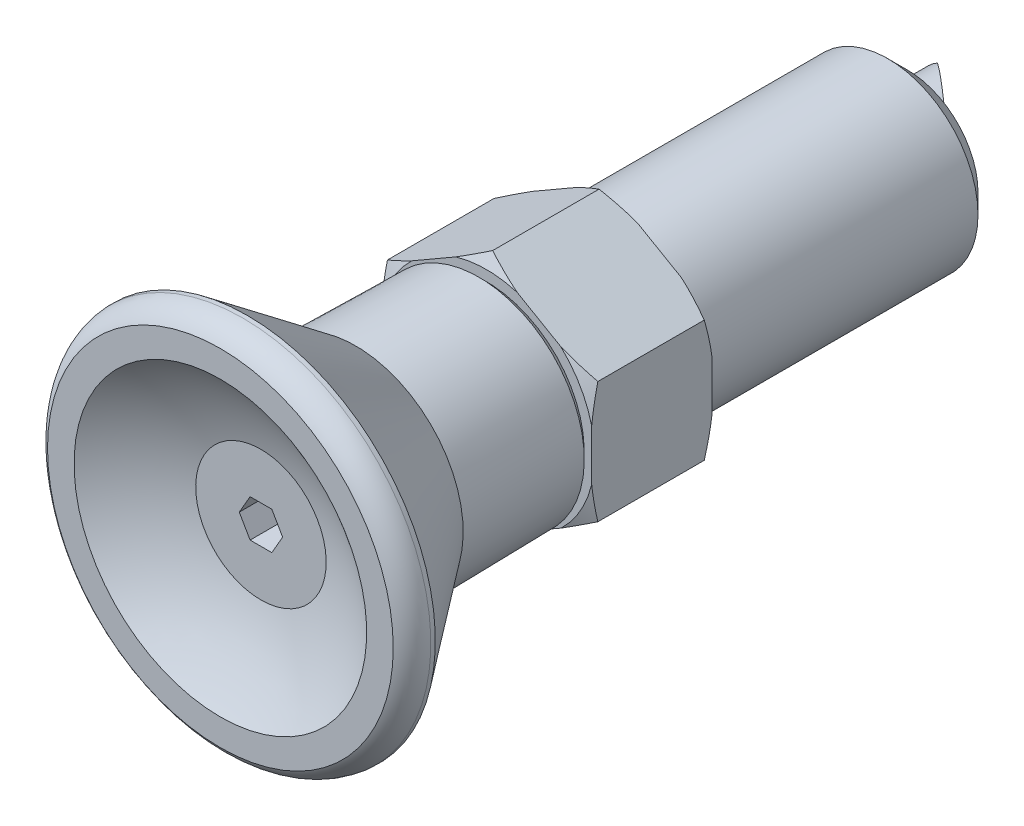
ISO-10303-21;
HEADER;
FILE_DESCRIPTION(('STEP AP214'),'2;1');
FILE_NAME('part.step','',(''),(''),'','','');
FILE_SCHEMA(('AUTOMOTIVE_DESIGN { 1 0 10303 214 1 1 1 1 }'));
ENDSEC;
DATA;
#1=APPLICATION_CONTEXT('core data for automotive mechanical design processes');
#2=APPLICATION_PROTOCOL_DEFINITION('international standard','automotive_design',2000,#1);
#3=PRODUCT_CONTEXT('',#1,'mechanical');
#4=PRODUCT('Part','Part','',(#3));
#5=PRODUCT_RELATED_PRODUCT_CATEGORY('part','',(#4));
#6=PRODUCT_DEFINITION_FORMATION('','',#4);
#7=PRODUCT_DEFINITION_CONTEXT('part definition',#1,'design');
#8=PRODUCT_DEFINITION('design','',#6,#7);
#9=PRODUCT_DEFINITION_SHAPE('','',#8);
#10=(LENGTH_UNIT() NAMED_UNIT(*) SI_UNIT(.MILLI.,.METRE.));
#11=(NAMED_UNIT(*) PLANE_ANGLE_UNIT() SI_UNIT($,.RADIAN.));
#12=(NAMED_UNIT(*) SI_UNIT($,.STERADIAN.) SOLID_ANGLE_UNIT());
#13=UNCERTAINTY_MEASURE_WITH_UNIT(LENGTH_MEASURE(1.E-05),#10,'distance_accuracy_value','');
#14=(GEOMETRIC_REPRESENTATION_CONTEXT(3) GLOBAL_UNCERTAINTY_ASSIGNED_CONTEXT((#13)) GLOBAL_UNIT_ASSIGNED_CONTEXT((#10,
#11,#12)) REPRESENTATION_CONTEXT('',''));
#15=CARTESIAN_POINT('',(0.,0.,0.));
#16=DIRECTION('',(0.,0.,1.));
#17=DIRECTION('',(1.,0.,0.));
#18=AXIS2_PLACEMENT_3D('',#15,#16,#17);
#19=CARTESIAN_POINT('',(0.,0.,23.));
#20=DIRECTION('',(0.,0.,-1.));
#21=DIRECTION('',(0.,-1.,0.));
#22=AXIS2_PLACEMENT_3D('',#19,#20,#21);
#23=PLANE('',#22);
#24=CARTESIAN_POINT('',(0.,0.,23.));
#25=DIRECTION('',(0.,0.,-1.));
#26=DIRECTION('',(0.,-1.,0.));
#27=AXIS2_PLACEMENT_3D('',#24,#25,#26);
#28=CIRCLE('',#27,4.34050688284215);
#29=CARTESIAN_POINT('',(0.,-4.34050688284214,23.));
#30=VERTEX_POINT('',#29);
#31=EDGE_CURVE('E520',#30,#30,#28,.T.);
#32=ORIENTED_EDGE('',*,*,#31,.F.);
#33=EDGE_LOOP('',(#32));
#34=FACE_BOUND('',#33,.T.);
#35=DIRECTION('',(0.5,-0.866025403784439,0.));
#36=VECTOR('',#35,1.);
#37=CARTESIAN_POINT('',(-1.44337567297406,0.,23.));
#38=LINE('',#37,#36);
#39=CARTESIAN_POINT('',(-1.44337567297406,0.,23.));
#40=VERTEX_POINT('',#39);
#41=CARTESIAN_POINT('',(-0.721687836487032,-1.25,23.));
#42=VERTEX_POINT('',#41);
#43=EDGE_CURVE('E228',#40,#42,#38,.T.);
#44=ORIENTED_EDGE('',*,*,#43,.F.);
#45=DIRECTION('',(-0.5,-0.866025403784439,0.));
#46=VECTOR('',#45,1.);
#47=CARTESIAN_POINT('',(-0.721687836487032,1.25,23.));
#48=LINE('',#47,#46);
#49=CARTESIAN_POINT('',(-0.721687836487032,1.25,23.));
#50=VERTEX_POINT('',#49);
#51=EDGE_CURVE('E226',#50,#40,#48,.T.);
#52=ORIENTED_EDGE('',*,*,#51,.F.);
#53=DIRECTION('',(-1.,0.,0.));
#54=VECTOR('',#53,1.);
#55=CARTESIAN_POINT('',(0.721687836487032,1.25,23.));
#56=LINE('',#55,#54);
#57=CARTESIAN_POINT('',(0.721687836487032,1.25,23.));
#58=VERTEX_POINT('',#57);
#59=EDGE_CURVE('E192',#58,#50,#56,.T.);
#60=ORIENTED_EDGE('',*,*,#59,.F.);
#61=DIRECTION('',(-0.5,0.866025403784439,0.));
#62=VECTOR('',#61,1.);
#63=CARTESIAN_POINT('',(1.44337567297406,0.,23.));
#64=LINE('',#63,#62);
#65=CARTESIAN_POINT('',(1.44337567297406,0.,23.));
#66=VERTEX_POINT('',#65);
#67=EDGE_CURVE('E212',#66,#58,#64,.T.);
#68=ORIENTED_EDGE('',*,*,#67,.F.);
#69=DIRECTION('',(0.5,0.866025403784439,0.));
#70=VECTOR('',#69,1.);
#71=CARTESIAN_POINT('',(0.721687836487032,-1.25,23.));
#72=LINE('',#71,#70);
#73=CARTESIAN_POINT('',(0.721687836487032,-1.25,23.));
#74=VERTEX_POINT('',#73);
#75=EDGE_CURVE('E28',#74,#66,#72,.T.);
#76=ORIENTED_EDGE('',*,*,#75,.F.);
#77=DIRECTION('',(-1.,0.,0.));
#78=VECTOR('',#77,1.);
#79=CARTESIAN_POINT('',(0.,-1.25,23.));
#80=LINE('',#79,#78);
#81=EDGE_CURVE('E9',#74,#42,#80,.T.);
#82=ORIENTED_EDGE('',*,*,#81,.T.);
#83=EDGE_LOOP('',(#44,#52,#60,#68,#76,#82));
#84=FACE_BOUND('',#83,.T.);
#85=ADVANCED_FACE('F14',(#34,#84),#23,.F.);
#86=CARTESIAN_POINT('',(0.,0.,38.4));
#87=DIRECTION('',(0.,0.,-1.));
#88=DIRECTION('',(0.,-1.,0.));
#89=AXIS2_PLACEMENT_3D('',#86,#87,#88);
#90=SPHERICAL_SURFACE('',#89,16.);
#91=CARTESIAN_POINT('',(0.,0.,25.7));
#92=DIRECTION('',(0.,0.,-1.));
#93=DIRECTION('',(0.,-1.,0.));
#94=AXIS2_PLACEMENT_3D('',#91,#92,#93);
#95=CIRCLE('',#94,9.73190628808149);
#96=CARTESIAN_POINT('',(0.,-9.73190628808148,25.7));
#97=VERTEX_POINT('',#96);
#98=EDGE_CURVE('E517',#97,#97,#95,.T.);
#99=CARTESIAN_POINT('',(0.,-9.73190628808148,25.7));
#100=CARTESIAN_POINT('',(0.,-9.68175159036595,25.6615668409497));
#101=CARTESIAN_POINT('',(0.,-9.6313692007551,25.6234308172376));
#102=CARTESIAN_POINT('',(0.,-9.53015615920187,25.5477583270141));
#103=CARTESIAN_POINT('',(0.,-9.47932550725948,25.5102218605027));
#104=CARTESIAN_POINT('',(0.,-9.37722306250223,25.4357537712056));
#105=CARTESIAN_POINT('',(0.,-9.32595126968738,25.3988221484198));
#106=CARTESIAN_POINT('',(0.,-9.22297374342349,25.3255689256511));
#107=CARTESIAN_POINT('',(0.,-9.17126800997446,25.2892473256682));
#108=CARTESIAN_POINT('',(0.,-9.06742985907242,25.217219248));
#109=CARTESIAN_POINT('',(0.,-9.0152974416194,25.1815127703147));
#110=CARTESIAN_POINT('',(0.,-8.91061324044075,25.1107199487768));
#111=CARTESIAN_POINT('',(0.,-8.85806145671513,25.0756336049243));
#112=CARTESIAN_POINT('',(0.,-8.75254589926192,25.0060859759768));
#113=CARTESIAN_POINT('',(0.,-8.69958212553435,24.9716246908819));
#114=CARTESIAN_POINT('',(0.,-8.59325002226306,24.9033320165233));
#115=CARTESIAN_POINT('',(0.,-8.53988169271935,24.8695006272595));
#116=CARTESIAN_POINT('',(0.,-8.43274796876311,24.8024724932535));
#117=CARTESIAN_POINT('',(0.,-8.37898257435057,24.7692757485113));
#118=CARTESIAN_POINT('',(0.,-8.27106226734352,24.7035215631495));
#119=CARTESIAN_POINT('',(0.,-8.21690735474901,24.67096412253));
#120=CARTESIAN_POINT('',(0.,-8.10821561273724,24.6064931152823));
#121=CARTESIAN_POINT('',(0.,-8.05367878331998,24.5745795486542));
#122=CARTESIAN_POINT('',(0.,-7.94423086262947,24.5114007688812));
#123=CARTESIAN_POINT('',(0.,-7.88931977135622,24.4801355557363));
#124=CARTESIAN_POINT('',(0.,-7.77913103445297,24.4182578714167));
#125=CARTESIAN_POINT('',(0.,-7.72385338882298,24.3876454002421));
#126=CARTESIAN_POINT('',(0.,-7.6129393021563,24.3270774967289));
#127=CARTESIAN_POINT('',(0.,-7.55730286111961,24.2971220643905));
#128=CARTESIAN_POINT('',(0.,-7.44567899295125,24.2378724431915));
#129=CARTESIAN_POINT('',(0.,-7.38969156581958,24.2085782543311));
#130=CARTESIAN_POINT('',(0.,-7.27737358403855,24.1506552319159));
#131=CARTESIAN_POINT('',(0.,-7.22104302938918,24.122026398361));
#132=CARTESIAN_POINT('',(0.,-7.10804669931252,24.0654381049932));
#133=CARTESIAN_POINT('',(0.,-7.05138092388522,24.0374786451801));
#134=CARTESIAN_POINT('',(0.,-6.93772210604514,23.9822330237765));
#135=CARTESIAN_POINT('',(0.,-6.88072906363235,23.9549468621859));
#136=CARTESIAN_POINT('',(0.,-6.76642371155,23.9010516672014));
#137=CARTESIAN_POINT('',(0.,-6.70911140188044,23.8744426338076));
#138=CARTESIAN_POINT('',(0.,-6.59417555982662,23.8219054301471));
#139=CARTESIAN_POINT('',(0.,-6.53655202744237,23.7959772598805));
#140=CARTESIAN_POINT('',(0.,-6.4210018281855,23.7448054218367));
#141=CARTESIAN_POINT('',(0.,-6.36307516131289,23.7195617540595));
#142=CARTESIAN_POINT('',(0.,-6.24692682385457,23.6697624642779));
#143=CARTESIAN_POINT('',(0.,-6.18870515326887,23.6452068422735));
#144=CARTESIAN_POINT('',(0.,-6.0719749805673,23.5967870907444));
#145=CARTESIAN_POINT('',(0.,-6.01346647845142,23.5729229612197));
#146=CARTESIAN_POINT('',(0.,-5.89617085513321,23.5258895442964));
#147=CARTESIAN_POINT('',(0.,-5.83738373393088,23.5027202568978));
#148=CARTESIAN_POINT('',(0.,-5.71953912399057,23.4570797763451));
#149=CARTESIAN_POINT('',(0.,-5.66048163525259,23.4346085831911));
#150=CARTESIAN_POINT('',(0.,-5.54210457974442,23.3903674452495));
#151=CARTESIAN_POINT('',(0.,-5.48278501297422,23.368597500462));
#152=CARTESIAN_POINT('',(0.,-5.36389212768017,23.325761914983));
#153=CARTESIAN_POINT('',(0.,-5.30431880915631,23.3046962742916));
#154=CARTESIAN_POINT('',(0.,-5.18492678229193,23.2632722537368));
#155=CARTESIAN_POINT('',(0.,-5.12510807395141,23.2429138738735));
#156=CARTESIAN_POINT('',(0.,-5.00523366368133,23.2029072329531));
#157=CARTESIAN_POINT('',(0.,-4.94517796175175,23.183258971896));
#158=CARTESIAN_POINT('',(0.,-4.82483799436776,23.1446753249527));
#159=CARTESIAN_POINT('',(0.,-4.76455372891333,23.1257399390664));
#160=CARTESIAN_POINT('',(0.,-4.64376509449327,23.0885847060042));
#161=CARTESIAN_POINT('',(0.,-4.58326072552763,23.0703648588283));
#162=CARTESIAN_POINT('',(0.,-4.46204038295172,23.0346432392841));
#163=CARTESIAN_POINT('',(0.,-4.40132440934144,23.0171414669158));
#164=CARTESIAN_POINT('',(0.,-4.34050688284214,23.));
#165=B_SPLINE_CURVE_WITH_KNOTS('',3,(#99,#100,#101,#102,#103,#104,#105,#106,#107,#108,#109,#110,
#111,#112,#113,#114,#115,#116,#117,#118,#119,#120,#121,#122,#123,#124,#125,#126,#127,#128,#129,
#130,#131,#132,#133,#134,#135,#136,#137,#138,#139,#140,#141,#142,#143,#144,#145,#146,#147,#148,
#149,#150,#151,#152,#153,#154,#155,#156,#157,#158,#159,#160,#161,#162,#163,#164),.UNSPECIFIED.,
.F.,.F.,(4,2,2,2,2,2,2,2,2,2,2,2,2,2,2,2,2,2,2,2,2,2,2,2,2,2,2,2,2,2,2,2,4),(0.,
0.189559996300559,0.379119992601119,0.568679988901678,0.758239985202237,0.947799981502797,
1.13735997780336,1.32691997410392,1.51647997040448,1.70603996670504,1.89559996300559,
2.08515995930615,2.27471995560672,2.46427995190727,2.65383994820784,2.84339994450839,
3.03295994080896,3.22251993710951,3.41207993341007,3.60163992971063,3.79119992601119,
3.98075992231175,4.17031991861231,4.35987991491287,4.54943991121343,4.73899990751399,
4.92855990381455,5.11811990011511,5.30767989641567,5.49723989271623,5.68679988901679,
5.87635988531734,6.06591988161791),.UNSPECIFIED.);
#166=EDGE_CURVE('BSEAM584',#97,#30,#165,.T.);
#167=ORIENTED_EDGE('',*,*,#98,.F.);
#168=ORIENTED_EDGE('',*,*,#31,.T.);
#169=ORIENTED_EDGE('',*,*,#166,.T.);
#170=ORIENTED_EDGE('',*,*,#166,.F.);
#171=EDGE_LOOP('',(#167,#169,#168,#170));
#172=FACE_BOUND('',#171,.T.);
#173=ADVANCED_FACE('F584',(#172),#90,.F.);
#174=CARTESIAN_POINT('',(0.,-9.73190628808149,25.7));
#175=DIRECTION('',(0.,0.,-1.));
#176=DIRECTION('',(0.,-1.,0.));
#177=AXIS2_PLACEMENT_3D('',#174,#175,#176);
#178=PLANE('',#177);
#179=CARTESIAN_POINT('',(0.,0.,25.7));
#180=DIRECTION('',(0.,0.,-1.));
#181=DIRECTION('',(0.,-1.,0.));
#182=AXIS2_PLACEMENT_3D('',#179,#180,#181);
#183=CIRCLE('',#182,11.5);
#184=CARTESIAN_POINT('',(0.,-11.5,25.7));
#185=VERTEX_POINT('',#184);
#186=EDGE_CURVE('E514',#185,#185,#183,.T.);
#187=ORIENTED_EDGE('',*,*,#186,.F.);
#188=EDGE_LOOP('',(#187));
#189=FACE_BOUND('',#188,.T.);
#190=ORIENTED_EDGE('',*,*,#98,.T.);
#191=EDGE_LOOP('',(#190));
#192=FACE_BOUND('',#191,.T.);
#193=ADVANCED_FACE('F590',(#189,#192),#178,.F.);
#194=CARTESIAN_POINT('',(0.,0.,23.9596620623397));
#195=DIRECTION('',(0.,0.,-1.));
#196=DIRECTION('',(0.,-1.,0.));
#197=AXIS2_PLACEMENT_3D('',#194,#195,#196);
#198=TOROIDAL_SURFACE('',#197,10.5144930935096,2.);
#199=ORIENTED_EDGE('',*,*,#186,.T.);
#200=EDGE_LOOP('',(#199));
#201=FACE_BOUND('',#200,.T.);
#202=CARTESIAN_POINT('',(0.,0.,24.2));
#203=DIRECTION('',(0.,0.,-1.));
#204=DIRECTION('',(0.,-1.,0.));
#205=AXIS2_PLACEMENT_3D('',#202,#203,#204);
#206=CIRCLE('',#205,12.5);
#207=CARTESIAN_POINT('',(0.,-12.5,24.2));
#208=VERTEX_POINT('',#207);
#209=EDGE_CURVE('E511',#208,#208,#206,.T.);
#210=ORIENTED_EDGE('',*,*,#209,.F.);
#211=EDGE_LOOP('',(#210));
#212=FACE_BOUND('',#211,.T.);
#213=ADVANCED_FACE('F698',(#201,#212),#198,.T.);
#214=CARTESIAN_POINT('',(0.,0.,-24.));
#215=DIRECTION('',(0.,0.,-1.));
#216=DIRECTION('',(0.,-1.,0.));
#217=AXIS2_PLACEMENT_3D('',#214,#215,#216);
#218=CYLINDRICAL_SURFACE('',#217,12.5);
#219=CARTESIAN_POINT('',(0.,0.,23.9));
#220=DIRECTION('',(0.,0.,-1.));
#221=DIRECTION('',(0.,-1.,0.));
#222=AXIS2_PLACEMENT_3D('',#219,#220,#221);
#223=CIRCLE('',#222,12.5);
#224=CARTESIAN_POINT('',(0.,-12.5,23.9));
#225=VERTEX_POINT('',#224);
#226=EDGE_CURVE('E508',#225,#225,#223,.T.);
#227=ORIENTED_EDGE('',*,*,#226,.F.);
#228=EDGE_LOOP('',(#227));
#229=FACE_BOUND('',#228,.T.);
#230=ORIENTED_EDGE('',*,*,#209,.T.);
#231=EDGE_LOOP('',(#230));
#232=FACE_BOUND('',#231,.T.);
#233=ADVANCED_FACE('F694',(#229,#232),#218,.T.);
#234=CARTESIAN_POINT('',(0.,0.,23.9));
#235=DIRECTION('',(0.,0.,1.));
#236=DIRECTION('',(0.,1.,0.));
#237=AXIS2_PLACEMENT_3D('',#234,#235,#236);
#238=CONICAL_SURFACE('',#237,12.5,0.638790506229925);
#239=CARTESIAN_POINT('',(0.,0.,16.6986913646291));
#240=DIRECTION('',(0.,0.,-1.));
#241=DIRECTION('',(0.,-1.,0.));
#242=AXIS2_PLACEMENT_3D('',#239,#240,#241);
#243=CIRCLE('',#242,7.15183622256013);
#244=CARTESIAN_POINT('',(0.,-7.15183622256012,16.6986913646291));
#245=VERTEX_POINT('',#244);
#246=EDGE_CURVE('E505',#245,#245,#243,.T.);
#247=ORIENTED_EDGE('',*,*,#246,.F.);
#248=EDGE_LOOP('',(#247));
#249=FACE_BOUND('',#248,.T.);
#250=ORIENTED_EDGE('',*,*,#226,.T.);
#251=EDGE_LOOP('',(#250));
#252=FACE_BOUND('',#251,.T.);
#253=ADVANCED_FACE('F690',(#249,#252),#238,.T.);
#254=CARTESIAN_POINT('',(0.,0.,16.6986913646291));
#255=DIRECTION('',(0.,0.,1.));
#256=DIRECTION('',(0.,1.,0.));
#257=AXIS2_PLACEMENT_3D('',#254,#255,#256);
#258=CONICAL_SURFACE('',#257,7.15183622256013,0.0174532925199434);
#259=CARTESIAN_POINT('',(0.,0.,8.4999238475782));
#260=DIRECTION('',(0.,0.,-1.));
#261=DIRECTION('',(0.,-1.,0.));
#262=AXIS2_PLACEMENT_3D('',#259,#260,#261);
#263=CIRCLE('',#262,7.00872620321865);
#264=CARTESIAN_POINT('',(0.,-7.00872620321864,8.4999238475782));
#265=VERTEX_POINT('',#264);
#266=EDGE_CURVE('E502',#265,#265,#263,.T.);
#267=ORIENTED_EDGE('',*,*,#266,.F.);
#268=EDGE_LOOP('',(#267));
#269=FACE_BOUND('',#268,.T.);
#270=ORIENTED_EDGE('',*,*,#246,.T.);
#271=EDGE_LOOP('',(#270));
#272=FACE_BOUND('',#271,.T.);
#273=ADVANCED_FACE('F686',(#269,#272),#258,.T.);
#274=CARTESIAN_POINT('',(0.,0.,8.4999238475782));
#275=DIRECTION('',(0.,0.,1.));
#276=DIRECTION('',(0.,1.,0.));
#277=AXIS2_PLACEMENT_3D('',#274,#275,#276);
#278=CONICAL_SURFACE('',#277,7.00872620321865,0.794124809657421);
#279=CARTESIAN_POINT('',(0.,0.,8.));
#280=DIRECTION('',(0.,0.,-1.));
#281=DIRECTION('',(0.,-1.,0.));
#282=AXIS2_PLACEMENT_3D('',#279,#280,#281);
#283=CIRCLE('',#282,6.5);
#284=CARTESIAN_POINT('',(0.,-6.49999999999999,8.));
#285=VERTEX_POINT('',#284);
#286=EDGE_CURVE('E499',#285,#285,#283,.T.);
#287=ORIENTED_EDGE('',*,*,#286,.F.);
#288=EDGE_LOOP('',(#287));
#289=FACE_BOUND('',#288,.T.);
#290=ORIENTED_EDGE('',*,*,#266,.T.);
#291=EDGE_LOOP('',(#290));
#292=FACE_BOUND('',#291,.T.);
#293=ADVANCED_FACE('F683',(#289,#292),#278,.T.);
#294=CARTESIAN_POINT('',(0.,0.,4.42559006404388));
#295=DIRECTION('',(0.,0.,-1.));
#296=DIRECTION('',(1.,0.,0.));
#297=AXIS2_PLACEMENT_3D('',#294,#295,#296);
#298=CONICAL_SURFACE('',#297,14.865346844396,1.13446401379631);
#299=CARTESIAN_POINT('',(5.30298288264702,11.144582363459,5.60227663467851));
#300=CARTESIAN_POINT('',(5.01981346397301,10.9810944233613,5.7278032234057));
#301=CARTESIAN_POINT('',(4.73609554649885,10.8172898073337,5.85171754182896));
#302=CARTESIAN_POINT('',(4.16724637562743,10.4888645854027,6.09532562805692));
#303=CARTESIAN_POINT('',(3.88211487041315,10.3242438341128,6.21501861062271));
#304=CARTESIAN_POINT('',(3.30858692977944,9.9931173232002,6.44981213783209));
#305=CARTESIAN_POINT('',(3.02018114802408,9.82660616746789,6.56488240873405));
#306=CARTESIAN_POINT('',(2.44141662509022,9.49245631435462,6.78824558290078));
#307=CARTESIAN_POINT('',(2.15105796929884,9.32481766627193,6.89653878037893));
#308=CARTESIAN_POINT('',(1.5725667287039,8.9908255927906,7.10285102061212));
#309=CARTESIAN_POINT('',(1.28447065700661,8.8244932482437,7.20100456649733));
#310=CARTESIAN_POINT('',(0.705732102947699,8.49035838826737,7.38661704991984));
#311=CARTESIAN_POINT('',(0.415089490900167,8.32255579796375,7.47407543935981));
#312=CARTESIAN_POINT('',(-0.460092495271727,7.8172692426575,7.71579372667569));
#313=CARTESIAN_POINT('',(-1.04923083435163,7.47713006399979,7.84990314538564));
#314=CARTESIAN_POINT('',(-1.88045774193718,6.99722098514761,7.98099862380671));
#315=CARTESIAN_POINT('',(-2.11859829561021,6.85973047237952,8.01197347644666));
#316=CARTESIAN_POINT('',(-2.59596951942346,6.58412006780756,8.05958012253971));
#317=CARTESIAN_POINT('',(-2.8352001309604,6.44600020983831,8.0762126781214));
#318=CARTESIAN_POINT('',(-3.31403578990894,6.16954431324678,8.09425806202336));
#319=CARTESIAN_POINT('',(-3.55364072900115,6.03120833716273,8.09567468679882));
#320=CARTESIAN_POINT('',(-4.03255245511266,5.75470852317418,8.08322265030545));
#321=CARTESIAN_POINT('',(-4.27185923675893,5.6165446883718,8.06935371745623));
#322=CARTESIAN_POINT('',(-4.74985568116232,5.34057331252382,8.02703191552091));
#323=CARTESIAN_POINT('',(-4.98854384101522,5.20276663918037,7.99855678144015));
#324=CARTESIAN_POINT('',(-5.46444378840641,4.92800567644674,7.92837307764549));
#325=CARTESIAN_POINT('',(-5.70165552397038,4.79105141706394,7.88666404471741));
#326=CARTESIAN_POINT('',(-6.17451144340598,4.51804792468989,7.7916675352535));
#327=CARTESIAN_POINT('',(-6.41015419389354,4.38199951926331,7.73837066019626));
#328=CARTESIAN_POINT('',(-6.87959906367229,4.11096539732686,7.62197333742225));
#329=CARTESIAN_POINT('',(-7.11340118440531,3.97597967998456,7.55887289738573));
#330=CARTESIAN_POINT('',(-7.55800145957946,3.71928959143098,7.43062001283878));
#331=CARTESIAN_POINT('',(-7.76895474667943,3.59749565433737,7.3661782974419));
#332=CARTESIAN_POINT('',(-8.18950409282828,3.35469137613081,7.2316122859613));
#333=CARTESIAN_POINT('',(-8.39910007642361,3.23368107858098,7.16148767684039));
#334=CARTESIAN_POINT('',(-8.81695769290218,2.99243087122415,7.01650991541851));
#335=CARTESIAN_POINT('',(-9.02521986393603,2.87219065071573,6.94165882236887));
#336=CARTESIAN_POINT('',(-9.44063831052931,2.63234869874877,6.78796771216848));
#337=CARTESIAN_POINT('',(-9.64779456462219,2.51274697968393,6.7091276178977));
#338=CARTESIAN_POINT('',(-10.0601897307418,2.27465051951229,6.54846119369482));
#339=CARTESIAN_POINT('',(-10.2654330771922,2.15615321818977,6.46664999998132));
#340=CARTESIAN_POINT('',(-10.6750653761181,1.91965190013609,6.3002228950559));
#341=CARTESIAN_POINT('',(-10.87945432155,1.80164788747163,6.21560696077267));
#342=CARTESIAN_POINT('',(-11.2874152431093,1.56611153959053,6.04402836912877));
#343=CARTESIAN_POINT('',(-11.4909874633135,1.44857906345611,5.95706648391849));
#344=CARTESIAN_POINT('',(-11.8974624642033,1.21390061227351,5.78111142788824));
#345=CARTESIAN_POINT('',(-12.1003652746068,1.0967546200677,5.69211834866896));
#346=CARTESIAN_POINT('',(-12.302982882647,0.979773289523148,5.60227663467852));
#347=B_SPLINE_CURVE_WITH_KNOTS('',3,(#299,#300,#301,#302,#303,#304,#305,#306,#307,#308,#309,
#310,#311,#312,#313,#314,#315,#316,#317,#318,#319,#320,#321,#322,#323,#324,#325,#326,#327,#328,
#329,#330,#331,#332,#333,#334,#335,#336,#337,#338,#339,#340,#341,#342,#343,#344,#345,#346),
.UNSPECIFIED.,.F.,.F.,(4,2,2,2,2,2,2,2,2,2,2,2,2,2,2,2,2,2,2,2,2,2,2,4),(0.,1.05074451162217,
2.10168345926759,3.15864943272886,4.21556948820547,5.25591248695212,6.2963087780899,
8.37220963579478,9.2020621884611,10.0318706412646,10.8614720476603,11.6910881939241,
12.521972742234,13.3528863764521,14.1844764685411,15.0160659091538,15.7718909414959,
16.5277576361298,17.2832972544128,18.0388514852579,18.790984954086,19.5431246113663,
20.2950196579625,21.0468808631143),.UNSPECIFIED.);
#348=CARTESIAN_POINT('',(-4.95945195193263,5.21956284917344,8.));
#349=VERTEX_POINT('',#348);
#350=CARTESIAN_POINT('',(-7.,4.04145188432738,7.58829521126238));
#351=VERTEX_POINT('',#350);
#352=EDGE_CURVE('E284',#349,#351,#347,.T.);
#353=ORIENTED_EDGE('',*,*,#352,.T.);
#354=CARTESIAN_POINT('',(-7.,9.3444347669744,5.913016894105));
#355=CARTESIAN_POINT('',(-7.,9.03314385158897,6.0291439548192));
#356=CARTESIAN_POINT('',(-7.,8.72118459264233,6.14352710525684));
#357=CARTESIAN_POINT('',(-7.,8.09556609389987,6.36775953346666));
#358=CARTESIAN_POINT('',(-7.,7.78190649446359,6.47760780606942));
#359=CARTESIAN_POINT('',(-7.,7.15070848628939,6.69233651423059));
#360=CARTESIAN_POINT('',(-7.,6.8331580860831,6.7971818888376));
#361=CARTESIAN_POINT('',(-7.,6.19577246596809,6.99966795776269));
#362=CARTESIAN_POINT('',(-7.,5.87593735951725,7.09730900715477));
#363=CARTESIAN_POINT('',(-7.,5.23933553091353,7.28183302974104));
#364=CARTESIAN_POINT('',(-7.,4.92261575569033,7.36887675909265));
#365=CARTESIAN_POINT('',(-7.,4.28630754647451,7.53193564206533));
#366=CARTESIAN_POINT('',(-7.,3.96671900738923,7.60795038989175));
#367=CARTESIAN_POINT('',(-7.,3.32528200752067,7.74610932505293));
#368=CARTESIAN_POINT('',(-7.,3.00344035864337,7.80828473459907));
#369=CARTESIAN_POINT('',(-7.,2.35697903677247,7.91606499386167));
#370=CARTESIAN_POINT('',(-7.,2.03235971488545,7.96167190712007));
#371=CARTESIAN_POINT('',(-7.,1.43052822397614,8.02814706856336));
#372=CARTESIAN_POINT('',(-7.,1.15361728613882,8.05172339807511));
#373=CARTESIAN_POINT('',(-7.,0.598919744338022,8.08384810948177));
#374=CARTESIAN_POINT('',(-7.,0.321133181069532,8.09239717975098));
#375=CARTESIAN_POINT('',(-7.,-0.234537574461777,8.09400100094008));
#376=CARTESIAN_POINT('',(-7.,-0.512421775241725,8.08705279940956));
#377=CARTESIAN_POINT('',(-7.,-1.06739520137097,8.05803672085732));
#378=CARTESIAN_POINT('',(-7.,-1.3444844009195,8.0359683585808));
#379=CARTESIAN_POINT('',(-7.,-1.89767458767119,7.97778245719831));
#380=CARTESIAN_POINT('',(-7.,-2.17377283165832,7.94163923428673));
#381=CARTESIAN_POINT('',(-7.,-2.72405919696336,7.8569074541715));
#382=CARTESIAN_POINT('',(-7.,-2.9982470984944,7.80831748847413));
#383=CARTESIAN_POINT('',(-7.,-3.54462761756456,7.70044931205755));
#384=CARTESIAN_POINT('',(-7.,-3.81681920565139,7.64116594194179));
#385=CARTESIAN_POINT('',(-7.,-4.35907351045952,7.51365048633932));
#386=CARTESIAN_POINT('',(-7.,-4.62913626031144,7.44541854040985));
#387=CARTESIAN_POINT('',(-7.,-5.2763335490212,7.27240192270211));
#388=CARTESIAN_POINT('',(-7.,-5.65250047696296,7.16401094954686));
#389=CARTESIAN_POINT('',(-7.,-6.40125063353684,6.93619814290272));
#390=CARTESIAN_POINT('',(-7.,-6.77383540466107,6.81678131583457));
#391=CARTESIAN_POINT('',(-7.,-7.51402093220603,6.57023080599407));
#392=CARTESIAN_POINT('',(-7.,-7.88163807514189,6.44314607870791));
#393=CARTESIAN_POINT('',(-7.,-8.43136700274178,6.24769687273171));
#394=CARTESIAN_POINT('',(-7.,-8.61434105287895,6.18173824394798));
#395=CARTESIAN_POINT('',(-7.,-8.97976552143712,6.048399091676));
#396=CARTESIAN_POINT('',(-7.,-9.16221595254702,5.98101860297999));
#397=CARTESIAN_POINT('',(-7.,-9.3444347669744,5.913016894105));
#398=B_SPLINE_CURVE_WITH_KNOTS('',3,(#354,#355,#356,#357,#358,#359,#360,#361,#362,#363,#364,
#365,#366,#367,#368,#369,#370,#371,#372,#373,#374,#375,#376,#377,#378,#379,#380,#381,#382,#383,
#384,#385,#386,#387,#388,#389,#390,#391,#392,#393,#394,#395,#396,#397),.UNSPECIFIED.,.F.,.F.,(4,
2,2,2,2,2,2,2,2,2,2,2,2,2,2,2,2,2,2,2,2,4),(0.,0.996758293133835,1.99373634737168,
2.99690161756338,4.00001741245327,4.98525032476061,5.97051947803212,6.95354276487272,
7.93644357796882,8.76980723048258,9.60313270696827,10.4366169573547,11.2701279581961,
12.1051671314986,12.9403008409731,13.7758385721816,14.6113632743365,15.7855344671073,
16.9591751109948,18.1259853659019,18.7094793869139,19.2929591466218),.UNSPECIFIED.);
#399=CARTESIAN_POINT('',(-7.,1.68522995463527,8.));
#400=VERTEX_POINT('',#399);
#401=EDGE_CURVE('E406',#351,#400,#398,.T.);
#402=ORIENTED_EDGE('',*,*,#401,.T.);
#403=CARTESIAN_POINT('',(0.,0.,8.));
#404=DIRECTION('',(0.,0.,-1.));
#405=DIRECTION('',(1.,0.,0.));
#406=AXIS2_PLACEMENT_3D('',#403,#404,#405);
#407=CIRCLE('',#406,7.2);
#408=EDGE_CURVE('E546',#400,#349,#407,.T.);
#409=ORIENTED_EDGE('',*,*,#408,.T.);
#410=EDGE_LOOP('',(#353,#402,#409));
#411=FACE_BOUND('',#410,.T.);
#412=ADVANCED_FACE('F313',(#411),#298,.T.);
#413=CARTESIAN_POINT('',(-7.,-1.68522995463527,8.));
#414=VERTEX_POINT('',#413);
#415=CARTESIAN_POINT('',(-7.,-4.04145188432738,7.58829521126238));
#416=VERTEX_POINT('',#415);
#417=EDGE_CURVE('E320',#414,#416,#398,.T.);
#418=ORIENTED_EDGE('',*,*,#417,.T.);
#419=CARTESIAN_POINT('',(-12.302982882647,-0.97977328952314,5.60227663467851));
#420=CARTESIAN_POINT('',(-12.019813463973,-1.14326122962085,5.7278032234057));
#421=CARTESIAN_POINT('',(-11.7360955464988,-1.30706584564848,5.85171754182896));
#422=CARTESIAN_POINT('',(-11.1672463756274,-1.63549106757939,6.09532562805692));
#423=CARTESIAN_POINT('',(-10.8821148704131,-1.8001118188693,6.21501861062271));
#424=CARTESIAN_POINT('',(-10.3085869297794,-2.13123832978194,6.44981213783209));
#425=CARTESIAN_POINT('',(-10.0201811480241,-2.29774948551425,6.56488240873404));
#426=CARTESIAN_POINT('',(-9.44141662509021,-2.63189933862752,6.78824558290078));
#427=CARTESIAN_POINT('',(-9.15105796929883,-2.79953798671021,6.89653878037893));
#428=CARTESIAN_POINT('',(-8.5725667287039,-3.13353006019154,7.10285102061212));
#429=CARTESIAN_POINT('',(-8.28447065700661,-3.29986240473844,7.20100456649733));
#430=CARTESIAN_POINT('',(-7.7057321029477,-3.63399726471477,7.38661704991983));
#431=CARTESIAN_POINT('',(-7.41508949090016,-3.80179985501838,7.47407543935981));
#432=CARTESIAN_POINT('',(-6.53990750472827,-4.30708641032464,7.71579372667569));
#433=CARTESIAN_POINT('',(-5.95076916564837,-4.64722558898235,7.84990314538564));
#434=CARTESIAN_POINT('',(-5.11954225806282,-5.12713466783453,7.98099862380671));
#435=CARTESIAN_POINT('',(-4.88140170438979,-5.26462518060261,8.01197347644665));
#436=CARTESIAN_POINT('',(-4.40403048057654,-5.54023558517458,8.05958012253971));
#437=CARTESIAN_POINT('',(-4.1647998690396,-5.67835544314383,8.0762126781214));
#438=CARTESIAN_POINT('',(-3.68596421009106,-5.95481133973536,8.09425806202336));
#439=CARTESIAN_POINT('',(-3.44635927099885,-6.09314731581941,8.09567468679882));
#440=CARTESIAN_POINT('',(-2.96744754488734,-6.36964712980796,8.08322265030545));
#441=CARTESIAN_POINT('',(-2.72814076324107,-6.50781096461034,8.06935371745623));
#442=CARTESIAN_POINT('',(-2.25014431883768,-6.78378234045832,8.02703191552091));
#443=CARTESIAN_POINT('',(-2.01145615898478,-6.92158901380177,7.99855678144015));
#444=CARTESIAN_POINT('',(-1.53555621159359,-7.1963499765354,7.92837307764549));
#445=CARTESIAN_POINT('',(-1.29834447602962,-7.33330423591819,7.88666404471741));
#446=CARTESIAN_POINT('',(-0.825488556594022,-7.60630772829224,7.7916675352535));
#447=CARTESIAN_POINT('',(-0.589845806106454,-7.74235613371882,7.73837066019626));
#448=CARTESIAN_POINT('',(-0.120400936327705,-8.01339025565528,7.62197333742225));
#449=CARTESIAN_POINT('',(0.113401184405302,-8.14837597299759,7.55887289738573));
#450=CARTESIAN_POINT('',(0.558001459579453,-8.40506606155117,7.43062001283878));
#451=CARTESIAN_POINT('',(0.768954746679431,-8.52685999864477,7.3661782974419));
#452=CARTESIAN_POINT('',(1.18950409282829,-8.76966427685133,7.2316122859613));
#453=CARTESIAN_POINT('',(1.39910007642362,-8.89067457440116,7.16148767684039));
#454=CARTESIAN_POINT('',(1.81695769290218,-9.13192478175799,7.01650991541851));
#455=CARTESIAN_POINT('',(2.02521986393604,-9.25216500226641,6.94165882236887));
#456=CARTESIAN_POINT('',(2.44063831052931,-9.49200695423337,6.78796771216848));
#457=CARTESIAN_POINT('',(2.64779456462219,-9.61160867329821,6.7091276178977));
#458=CARTESIAN_POINT('',(3.06018973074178,-9.84970513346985,6.54846119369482));
#459=CARTESIAN_POINT('',(3.26543307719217,-9.96820243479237,6.46664999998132));
#460=CARTESIAN_POINT('',(3.67506537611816,-10.204703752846,6.30022289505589));
#461=CARTESIAN_POINT('',(3.87945432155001,-10.3227077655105,6.21560696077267));
#462=CARTESIAN_POINT('',(4.28741524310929,-10.5582441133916,6.04402836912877));
#463=CARTESIAN_POINT('',(4.49098746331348,-10.675776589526,5.95706648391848));
#464=CARTESIAN_POINT('',(4.89746246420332,-10.9104550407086,5.78111142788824));
#465=CARTESIAN_POINT('',(5.10036527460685,-11.0276010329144,5.69211834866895));
#466=CARTESIAN_POINT('',(5.30298288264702,-11.144582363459,5.60227663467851));
#467=B_SPLINE_CURVE_WITH_KNOTS('',3,(#419,#420,#421,#422,#423,#424,#425,#426,#427,#428,#429,
#430,#431,#432,#433,#434,#435,#436,#437,#438,#439,#440,#441,#442,#443,#444,#445,#446,#447,#448,
#449,#450,#451,#452,#453,#454,#455,#456,#457,#458,#459,#460,#461,#462,#463,#464,#465,#466),
.UNSPECIFIED.,.F.,.F.,(4,2,2,2,2,2,2,2,2,2,2,2,2,2,2,2,2,2,2,2,2,2,2,4),(0.,1.05074451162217,
2.10168345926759,3.15864943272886,4.21556948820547,5.25591248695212,6.29630877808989,
8.37220963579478,9.2020621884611,10.0318706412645,10.8614720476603,11.6910881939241,
12.521972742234,13.3528863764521,14.1844764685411,15.0160659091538,15.7718909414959,
16.5277576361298,17.2832972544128,18.0388514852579,18.790984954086,19.5431246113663,
20.2950196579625,21.0468808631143),.UNSPECIFIED.);
#468=CARTESIAN_POINT('',(-4.95945195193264,-5.21956284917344,8.));
#469=VERTEX_POINT('',#468);
#470=EDGE_CURVE('E388',#416,#469,#467,.T.);
#471=ORIENTED_EDGE('',*,*,#470,.T.);
#472=EDGE_CURVE('E544',#469,#414,#407,.T.);
#473=ORIENTED_EDGE('',*,*,#472,.T.);
#474=EDGE_LOOP('',(#418,#471,#473));
#475=FACE_BOUND('',#474,.T.);
#476=ADVANCED_FACE('F754',(#475),#298,.T.);
#477=CARTESIAN_POINT('',(2.04054804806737,-6.9047928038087,8.));
#478=VERTEX_POINT('',#477);
#479=CARTESIAN_POINT('',(-2.04054804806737,-6.9047928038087,8.));
#480=VERTEX_POINT('',#479);
#481=EDGE_CURVE('E457',#478,#480,#407,.T.);
#482=ORIENTED_EDGE('',*,*,#481,.T.);
#483=CARTESIAN_POINT('',(0.,-8.08290376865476,7.58829521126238));
#484=VERTEX_POINT('',#483);
#485=EDGE_CURVE('E328',#480,#484,#467,.T.);
#486=ORIENTED_EDGE('',*,*,#485,.T.);
#487=CARTESIAN_POINT('',(-5.30298288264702,-11.144582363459,5.60227663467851));
#488=CARTESIAN_POINT('',(-5.01981346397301,-10.9810944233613,5.7278032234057));
#489=CARTESIAN_POINT('',(-4.73609554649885,-10.8172898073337,5.85171754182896));
#490=CARTESIAN_POINT('',(-4.16724637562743,-10.4888645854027,6.09532562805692));
#491=CARTESIAN_POINT('',(-3.88211487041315,-10.3242438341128,6.21501861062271));
#492=CARTESIAN_POINT('',(-3.30858692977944,-9.9931173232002,6.44981213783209));
#493=CARTESIAN_POINT('',(-3.02018114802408,-9.82660616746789,6.56488240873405));
#494=CARTESIAN_POINT('',(-2.44141662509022,-9.49245631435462,6.78824558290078));
#495=CARTESIAN_POINT('',(-2.15105796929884,-9.32481766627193,6.89653878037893));
#496=CARTESIAN_POINT('',(-1.5725667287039,-8.9908255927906,7.10285102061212));
#497=CARTESIAN_POINT('',(-1.28447065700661,-8.8244932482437,7.20100456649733));
#498=CARTESIAN_POINT('',(-0.705732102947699,-8.49035838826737,7.38661704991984));
#499=CARTESIAN_POINT('',(-0.415089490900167,-8.32255579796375,7.47407543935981));
#500=CARTESIAN_POINT('',(0.460092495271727,-7.8172692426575,7.71579372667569));
#501=CARTESIAN_POINT('',(1.04923083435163,-7.47713006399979,7.84990314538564));
#502=CARTESIAN_POINT('',(1.88045774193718,-6.99722098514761,7.98099862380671));
#503=CARTESIAN_POINT('',(2.11859829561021,-6.85973047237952,8.01197347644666));
#504=CARTESIAN_POINT('',(2.59596951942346,-6.58412006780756,8.05958012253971));
#505=CARTESIAN_POINT('',(2.8352001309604,-6.44600020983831,8.0762126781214));
#506=CARTESIAN_POINT('',(3.31403578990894,-6.16954431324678,8.09425806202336));
#507=CARTESIAN_POINT('',(3.55364072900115,-6.03120833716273,8.09567468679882));
#508=CARTESIAN_POINT('',(4.03255245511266,-5.75470852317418,8.08322265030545));
#509=CARTESIAN_POINT('',(4.27185923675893,-5.6165446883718,8.06935371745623));
#510=CARTESIAN_POINT('',(4.74985568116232,-5.34057331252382,8.02703191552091));
#511=CARTESIAN_POINT('',(4.98854384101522,-5.20276663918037,7.99855678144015));
#512=CARTESIAN_POINT('',(5.46444378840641,-4.92800567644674,7.92837307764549));
#513=CARTESIAN_POINT('',(5.70165552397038,-4.79105141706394,7.88666404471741));
#514=CARTESIAN_POINT('',(6.17451144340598,-4.51804792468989,7.7916675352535));
#515=CARTESIAN_POINT('',(6.41015419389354,-4.38199951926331,7.73837066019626));
#516=CARTESIAN_POINT('',(6.87959906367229,-4.11096539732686,7.62197333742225));
#517=CARTESIAN_POINT('',(7.11340118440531,-3.97597967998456,7.55887289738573));
#518=CARTESIAN_POINT('',(7.55800145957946,-3.71928959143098,7.43062001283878));
#519=CARTESIAN_POINT('',(7.76895474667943,-3.59749565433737,7.3661782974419));
#520=CARTESIAN_POINT('',(8.18950409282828,-3.35469137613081,7.2316122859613));
#521=CARTESIAN_POINT('',(8.39910007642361,-3.23368107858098,7.16148767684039));
#522=CARTESIAN_POINT('',(8.81695769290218,-2.99243087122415,7.01650991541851));
#523=CARTESIAN_POINT('',(9.02521986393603,-2.87219065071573,6.94165882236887));
#524=CARTESIAN_POINT('',(9.44063831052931,-2.63234869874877,6.78796771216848));
#525=CARTESIAN_POINT('',(9.64779456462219,-2.51274697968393,6.7091276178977));
#526=CARTESIAN_POINT('',(10.0601897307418,-2.27465051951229,6.54846119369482));
#527=CARTESIAN_POINT('',(10.2654330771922,-2.15615321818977,6.46664999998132));
#528=CARTESIAN_POINT('',(10.6750653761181,-1.91965190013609,6.3002228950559));
#529=CARTESIAN_POINT('',(10.87945432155,-1.80164788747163,6.21560696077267));
#530=CARTESIAN_POINT('',(11.2874152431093,-1.56611153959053,6.04402836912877));
#531=CARTESIAN_POINT('',(11.4909874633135,-1.44857906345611,5.95706648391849));
#532=CARTESIAN_POINT('',(11.8974624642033,-1.21390061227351,5.78111142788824));
#533=CARTESIAN_POINT('',(12.1003652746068,-1.0967546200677,5.69211834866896));
#534=CARTESIAN_POINT('',(12.302982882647,-0.979773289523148,5.60227663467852));
#535=B_SPLINE_CURVE_WITH_KNOTS('',3,(#487,#488,#489,#490,#491,#492,#493,#494,#495,#496,#497,
#498,#499,#500,#501,#502,#503,#504,#505,#506,#507,#508,#509,#510,#511,#512,#513,#514,#515,#516,
#517,#518,#519,#520,#521,#522,#523,#524,#525,#526,#527,#528,#529,#530,#531,#532,#533,#534),
.UNSPECIFIED.,.F.,.F.,(4,2,2,2,2,2,2,2,2,2,2,2,2,2,2,2,2,2,2,2,2,2,2,4),(0.,1.05074451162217,
2.10168345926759,3.15864943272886,4.21556948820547,5.25591248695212,6.2963087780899,
8.37220963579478,9.2020621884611,10.0318706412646,10.8614720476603,11.6910881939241,
12.521972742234,13.3528863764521,14.1844764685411,15.0160659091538,15.7718909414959,
16.5277576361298,17.2832972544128,18.0388514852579,18.790984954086,19.5431246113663,
20.2950196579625,21.0468808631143),.UNSPECIFIED.);
#536=EDGE_CURVE('E569',#484,#478,#535,.T.);
#537=ORIENTED_EDGE('',*,*,#536,.T.);
#538=EDGE_LOOP('',(#482,#486,#537));
#539=FACE_BOUND('',#538,.T.);
#540=ADVANCED_FACE('F570',(#539),#298,.T.);
#541=CARTESIAN_POINT('',(4.95945195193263,-5.21956284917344,8.));
#542=VERTEX_POINT('',#541);
#543=CARTESIAN_POINT('',(7.,-4.04145188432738,7.58829521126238));
#544=VERTEX_POINT('',#543);
#545=EDGE_CURVE('E335',#542,#544,#535,.T.);
#546=ORIENTED_EDGE('',*,*,#545,.T.);
#547=CARTESIAN_POINT('',(7.,-9.3444347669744,5.913016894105));
#548=CARTESIAN_POINT('',(7.,-9.03314385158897,6.0291439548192));
#549=CARTESIAN_POINT('',(7.,-8.72118459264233,6.14352710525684));
#550=CARTESIAN_POINT('',(7.,-8.09556609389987,6.36775953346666));
#551=CARTESIAN_POINT('',(7.,-7.78190649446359,6.47760780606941));
#552=CARTESIAN_POINT('',(7.,-7.1507084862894,6.69233651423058));
#553=CARTESIAN_POINT('',(7.,-6.8331580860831,6.7971818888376));
#554=CARTESIAN_POINT('',(7.,-6.19577246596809,6.99966795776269));
#555=CARTESIAN_POINT('',(7.,-5.87593735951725,7.09730900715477));
#556=CARTESIAN_POINT('',(7.,-5.23933553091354,7.28183302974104));
#557=CARTESIAN_POINT('',(7.,-4.92261575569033,7.36887675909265));
#558=CARTESIAN_POINT('',(7.,-4.28630754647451,7.53193564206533));
#559=CARTESIAN_POINT('',(7.,-3.96671900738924,7.60795038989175));
#560=CARTESIAN_POINT('',(7.,-3.32528200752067,7.74610932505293));
#561=CARTESIAN_POINT('',(7.,-3.00344035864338,7.80828473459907));
#562=CARTESIAN_POINT('',(7.,-2.35697903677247,7.91606499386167));
#563=CARTESIAN_POINT('',(7.,-2.03235971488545,7.96167190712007));
#564=CARTESIAN_POINT('',(7.,-1.43052822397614,8.02814706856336));
#565=CARTESIAN_POINT('',(7.,-1.15361728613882,8.05172339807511));
#566=CARTESIAN_POINT('',(7.,-0.598919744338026,8.08384810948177));
#567=CARTESIAN_POINT('',(7.,-0.321133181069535,8.09239717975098));
#568=CARTESIAN_POINT('',(7.,0.234537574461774,8.09400100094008));
#569=CARTESIAN_POINT('',(7.,0.512421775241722,8.08705279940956));
#570=CARTESIAN_POINT('',(7.,1.06739520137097,8.05803672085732));
#571=CARTESIAN_POINT('',(7.,1.3444844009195,8.0359683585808));
#572=CARTESIAN_POINT('',(7.,1.89767458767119,7.97778245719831));
#573=CARTESIAN_POINT('',(7.,2.17377283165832,7.94163923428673));
#574=CARTESIAN_POINT('',(7.,2.72405919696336,7.8569074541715));
#575=CARTESIAN_POINT('',(7.,2.9982470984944,7.80831748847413));
#576=CARTESIAN_POINT('',(7.,3.54462761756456,7.70044931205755));
#577=CARTESIAN_POINT('',(7.,3.81681920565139,7.64116594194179));
#578=CARTESIAN_POINT('',(7.,4.35907351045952,7.51365048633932));
#579=CARTESIAN_POINT('',(7.,4.62913626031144,7.44541854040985));
#580=CARTESIAN_POINT('',(7.,5.2763335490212,7.27240192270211));
#581=CARTESIAN_POINT('',(7.,5.65250047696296,7.16401094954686));
#582=CARTESIAN_POINT('',(7.,6.40125063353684,6.93619814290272));
#583=CARTESIAN_POINT('',(7.,6.77383540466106,6.81678131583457));
#584=CARTESIAN_POINT('',(7.,7.51402093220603,6.57023080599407));
#585=CARTESIAN_POINT('',(7.,7.88163807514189,6.44314607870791));
#586=CARTESIAN_POINT('',(7.,8.43136700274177,6.24769687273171));
#587=CARTESIAN_POINT('',(7.,8.61434105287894,6.18173824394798));
#588=CARTESIAN_POINT('',(7.,8.97976552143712,6.048399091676));
#589=CARTESIAN_POINT('',(7.,9.16221595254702,5.98101860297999));
#590=CARTESIAN_POINT('',(7.,9.3444347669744,5.913016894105));
#591=B_SPLINE_CURVE_WITH_KNOTS('',3,(#547,#548,#549,#550,#551,#552,#553,#554,#555,#556,#557,
#558,#559,#560,#561,#562,#563,#564,#565,#566,#567,#568,#569,#570,#571,#572,#573,#574,#575,#576,
#577,#578,#579,#580,#581,#582,#583,#584,#585,#586,#587,#588,#589,#590),.UNSPECIFIED.,.F.,.F.,(4,
2,2,2,2,2,2,2,2,2,2,2,2,2,2,2,2,2,2,2,2,4),(0.,0.996758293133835,1.99373634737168,
2.99690161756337,4.00001741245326,4.98525032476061,5.97051947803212,6.95354276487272,
7.93644357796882,8.76980723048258,9.60313270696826,10.4366169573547,11.2701279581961,
12.1051671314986,12.9403008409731,13.7758385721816,14.6113632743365,15.7855344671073,
16.9591751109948,18.1259853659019,18.7094793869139,19.2929591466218),.UNSPECIFIED.);
#592=CARTESIAN_POINT('',(7.,-1.68522995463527,8.));
#593=VERTEX_POINT('',#592);
#594=EDGE_CURVE('E351',#544,#593,#591,.T.);
#595=ORIENTED_EDGE('',*,*,#594,.T.);
#596=EDGE_CURVE('E545',#593,#542,#407,.T.);
#597=ORIENTED_EDGE('',*,*,#596,.T.);
#598=EDGE_LOOP('',(#546,#595,#597));
#599=FACE_BOUND('',#598,.T.);
#600=ADVANCED_FACE('F311',(#599),#298,.T.);
#601=CARTESIAN_POINT('',(7.,1.68522995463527,8.));
#602=VERTEX_POINT('',#601);
#603=CARTESIAN_POINT('',(7.,4.04145188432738,7.58829521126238));
#604=VERTEX_POINT('',#603);
#605=EDGE_CURVE('E343',#602,#604,#591,.T.);
#606=ORIENTED_EDGE('',*,*,#605,.T.);
#607=CARTESIAN_POINT('',(12.302982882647,0.97977328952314,5.60227663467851));
#608=CARTESIAN_POINT('',(12.019813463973,1.14326122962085,5.7278032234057));
#609=CARTESIAN_POINT('',(11.7360955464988,1.30706584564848,5.85171754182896));
#610=CARTESIAN_POINT('',(11.1672463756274,1.63549106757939,6.09532562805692));
#611=CARTESIAN_POINT('',(10.8821148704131,1.8001118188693,6.21501861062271));
#612=CARTESIAN_POINT('',(10.3085869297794,2.13123832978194,6.44981213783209));
#613=CARTESIAN_POINT('',(10.0201811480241,2.29774948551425,6.56488240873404));
#614=CARTESIAN_POINT('',(9.44141662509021,2.63189933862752,6.78824558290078));
#615=CARTESIAN_POINT('',(9.15105796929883,2.79953798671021,6.89653878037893));
#616=CARTESIAN_POINT('',(8.5725667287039,3.13353006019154,7.10285102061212));
#617=CARTESIAN_POINT('',(8.28447065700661,3.29986240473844,7.20100456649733));
#618=CARTESIAN_POINT('',(7.7057321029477,3.63399726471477,7.38661704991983));
#619=CARTESIAN_POINT('',(7.41508949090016,3.80179985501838,7.47407543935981));
#620=CARTESIAN_POINT('',(6.53990750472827,4.30708641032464,7.71579372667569));
#621=CARTESIAN_POINT('',(5.95076916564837,4.64722558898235,7.84990314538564));
#622=CARTESIAN_POINT('',(5.11954225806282,5.12713466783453,7.98099862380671));
#623=CARTESIAN_POINT('',(4.88140170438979,5.26462518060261,8.01197347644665));
#624=CARTESIAN_POINT('',(4.40403048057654,5.54023558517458,8.05958012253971));
#625=CARTESIAN_POINT('',(4.1647998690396,5.67835544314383,8.0762126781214));
#626=CARTESIAN_POINT('',(3.68596421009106,5.95481133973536,8.09425806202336));
#627=CARTESIAN_POINT('',(3.44635927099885,6.09314731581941,8.09567468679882));
#628=CARTESIAN_POINT('',(2.96744754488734,6.36964712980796,8.08322265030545));
#629=CARTESIAN_POINT('',(2.72814076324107,6.50781096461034,8.06935371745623));
#630=CARTESIAN_POINT('',(2.25014431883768,6.78378234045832,8.02703191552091));
#631=CARTESIAN_POINT('',(2.01145615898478,6.92158901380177,7.99855678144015));
#632=CARTESIAN_POINT('',(1.53555621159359,7.1963499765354,7.92837307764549));
#633=CARTESIAN_POINT('',(1.29834447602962,7.33330423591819,7.88666404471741));
#634=CARTESIAN_POINT('',(0.825488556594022,7.60630772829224,7.7916675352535));
#635=CARTESIAN_POINT('',(0.589845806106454,7.74235613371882,7.73837066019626));
#636=CARTESIAN_POINT('',(0.120400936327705,8.01339025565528,7.62197333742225));
#637=CARTESIAN_POINT('',(-0.113401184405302,8.14837597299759,7.55887289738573));
#638=CARTESIAN_POINT('',(-0.558001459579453,8.40506606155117,7.43062001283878));
#639=CARTESIAN_POINT('',(-0.768954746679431,8.52685999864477,7.3661782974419));
#640=CARTESIAN_POINT('',(-1.18950409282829,8.76966427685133,7.2316122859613));
#641=CARTESIAN_POINT('',(-1.39910007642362,8.89067457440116,7.16148767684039));
#642=CARTESIAN_POINT('',(-1.81695769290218,9.13192478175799,7.01650991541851));
#643=CARTESIAN_POINT('',(-2.02521986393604,9.25216500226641,6.94165882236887));
#644=CARTESIAN_POINT('',(-2.44063831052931,9.49200695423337,6.78796771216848));
#645=CARTESIAN_POINT('',(-2.64779456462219,9.61160867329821,6.7091276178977));
#646=CARTESIAN_POINT('',(-3.06018973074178,9.84970513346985,6.54846119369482));
#647=CARTESIAN_POINT('',(-3.26543307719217,9.96820243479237,6.46664999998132));
#648=CARTESIAN_POINT('',(-3.67506537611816,10.204703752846,6.30022289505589));
#649=CARTESIAN_POINT('',(-3.87945432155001,10.3227077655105,6.21560696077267));
#650=CARTESIAN_POINT('',(-4.28741524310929,10.5582441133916,6.04402836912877));
#651=CARTESIAN_POINT('',(-4.49098746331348,10.675776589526,5.95706648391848));
#652=CARTESIAN_POINT('',(-4.89746246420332,10.9104550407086,5.78111142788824));
#653=CARTESIAN_POINT('',(-5.10036527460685,11.0276010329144,5.69211834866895));
#654=CARTESIAN_POINT('',(-5.30298288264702,11.144582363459,5.60227663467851));
#655=B_SPLINE_CURVE_WITH_KNOTS('',3,(#607,#608,#609,#610,#611,#612,#613,#614,#615,#616,#617,
#618,#619,#620,#621,#622,#623,#624,#625,#626,#627,#628,#629,#630,#631,#632,#633,#634,#635,#636,
#637,#638,#639,#640,#641,#642,#643,#644,#645,#646,#647,#648,#649,#650,#651,#652,#653,#654),
.UNSPECIFIED.,.F.,.F.,(4,2,2,2,2,2,2,2,2,2,2,2,2,2,2,2,2,2,2,2,2,2,2,4),(0.,1.05074451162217,
2.10168345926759,3.15864943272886,4.21556948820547,5.25591248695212,6.29630877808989,
8.37220963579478,9.2020621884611,10.0318706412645,10.8614720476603,11.6910881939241,
12.521972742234,13.3528863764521,14.1844764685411,15.0160659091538,15.7718909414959,
16.5277576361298,17.2832972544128,18.0388514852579,18.790984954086,19.5431246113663,
20.2950196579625,21.0468808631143),.UNSPECIFIED.);
#656=CARTESIAN_POINT('',(4.95945195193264,5.21956284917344,8.));
#657=VERTEX_POINT('',#656);
#658=EDGE_CURVE('E549',#604,#657,#655,.T.);
#659=ORIENTED_EDGE('',*,*,#658,.T.);
#660=EDGE_CURVE('E548',#657,#602,#407,.T.);
#661=ORIENTED_EDGE('',*,*,#660,.T.);
#662=EDGE_LOOP('',(#606,#659,#661));
#663=FACE_BOUND('',#662,.T.);
#664=ADVANCED_FACE('F307',(#663),#298,.T.);
#665=CARTESIAN_POINT('',(0.,-7.2,8.));
#666=DIRECTION('',(0.,0.,1.));
#667=DIRECTION('',(-1.,0.,0.));
#668=AXIS2_PLACEMENT_3D('',#665,#666,#667);
#669=PLANE('',#668);
#670=ORIENTED_EDGE('',*,*,#286,.T.);
#671=EDGE_LOOP('',(#670));
#672=FACE_BOUND('',#671,.T.);
#673=ORIENTED_EDGE('',*,*,#660,.F.);
#674=DIRECTION('',(-0.866025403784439,0.5,0.));
#675=VECTOR('',#674,1.);
#676=CARTESIAN_POINT('',(7.,4.04145188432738,8.));
#677=LINE('',#676,#675);
#678=CARTESIAN_POINT('',(2.04054804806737,6.9047928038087,8.));
#679=VERTEX_POINT('',#678);
#680=EDGE_CURVE('E255',#657,#679,#677,.T.);
#681=ORIENTED_EDGE('',*,*,#680,.T.);
#682=CARTESIAN_POINT('',(-2.04054804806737,6.9047928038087,8.));
#683=VERTEX_POINT('',#682);
#684=EDGE_CURVE('E555',#683,#679,#407,.T.);
#685=ORIENTED_EDGE('',*,*,#684,.F.);
#686=DIRECTION('',(-0.866025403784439,-0.5,0.));
#687=VECTOR('',#686,1.);
#688=CARTESIAN_POINT('',(0.,8.08290376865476,8.));
#689=LINE('',#688,#687);
#690=EDGE_CURVE('E196',#683,#349,#689,.T.);
#691=ORIENTED_EDGE('',*,*,#690,.T.);
#692=ORIENTED_EDGE('',*,*,#408,.F.);
#693=DIRECTION('',(0.,-1.,0.));
#694=VECTOR('',#693,1.);
#695=CARTESIAN_POINT('',(-7.,4.04145188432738,8.));
#696=LINE('',#695,#694);
#697=EDGE_CURVE('E243',#400,#414,#696,.T.);
#698=ORIENTED_EDGE('',*,*,#697,.T.);
#699=ORIENTED_EDGE('',*,*,#472,.F.);
#700=DIRECTION('',(0.866025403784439,-0.5,0.));
#701=VECTOR('',#700,1.);
#702=CARTESIAN_POINT('',(-7.,-4.04145188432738,8.));
#703=LINE('',#702,#701);
#704=EDGE_CURVE('E246',#469,#480,#703,.T.);
#705=ORIENTED_EDGE('',*,*,#704,.T.);
#706=ORIENTED_EDGE('',*,*,#481,.F.);
#707=DIRECTION('',(0.866025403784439,0.5,0.));
#708=VECTOR('',#707,1.);
#709=CARTESIAN_POINT('',(0.,-8.08290376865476,8.));
#710=LINE('',#709,#708);
#711=EDGE_CURVE('E249',#478,#542,#710,.T.);
#712=ORIENTED_EDGE('',*,*,#711,.T.);
#713=ORIENTED_EDGE('',*,*,#596,.F.);
#714=DIRECTION('',(0.,1.,0.));
#715=VECTOR('',#714,1.);
#716=CARTESIAN_POINT('',(7.,-4.04145188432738,8.));
#717=LINE('',#716,#715);
#718=EDGE_CURVE('E252',#593,#602,#717,.T.);
#719=ORIENTED_EDGE('',*,*,#718,.T.);
#720=EDGE_LOOP('',(#673,#681,#685,#691,#692,#698,#699,#705,#706,#712,#713,#719));
#721=FACE_BOUND('',#720,.T.);
#722=ADVANCED_FACE('F304',(#672,#721),#669,.T.);
#723=ORIENTED_EDGE('',*,*,#684,.T.);
#724=CARTESIAN_POINT('',(0.,8.08290376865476,7.58829521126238));
#725=VERTEX_POINT('',#724);
#726=EDGE_CURVE('E557',#679,#725,#655,.T.);
#727=ORIENTED_EDGE('',*,*,#726,.T.);
#728=EDGE_CURVE('E423',#725,#683,#347,.T.);
#729=ORIENTED_EDGE('',*,*,#728,.T.);
#730=EDGE_LOOP('',(#723,#727,#729));
#731=FACE_BOUND('',#730,.T.);
#732=ADVANCED_FACE('F300',(#731),#298,.T.);
#733=CARTESIAN_POINT('',(0.,8.08290376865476,0.));
#734=DIRECTION('',(-0.5,0.866025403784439,0.));
#735=DIRECTION('',(-0.866025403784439,-0.5,0.));
#736=AXIS2_PLACEMENT_3D('',#733,#734,#735);
#737=PLANE('',#736);
#738=DIRECTION('',(0.,0.,1.));
#739=VECTOR('',#738,1.);
#740=CARTESIAN_POINT('',(0.,8.08290376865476,0.));
#741=LINE('',#740,#739);
#742=CARTESIAN_POINT('',(0.,8.08290376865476,0.50974472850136));
#743=VERTEX_POINT('',#742);
#744=EDGE_CURVE('E258',#743,#725,#741,.T.);
#745=ORIENTED_EDGE('',*,*,#744,.F.);
#746=CARTESIAN_POINT('',(-12.5292962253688,0.84911122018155,3.09346319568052));
#747=CARTESIAN_POINT('',(-12.3020367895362,0.980319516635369,2.96770106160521));
#748=CARTESIAN_POINT('',(-12.0742896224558,1.11180940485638,2.84309850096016));
#749=CARTESIAN_POINT('',(-11.6176105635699,1.37547318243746,2.59675662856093));
#750=CARTESIAN_POINT('',(-11.3886785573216,1.50764713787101,2.47501759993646));
#751=CARTESIAN_POINT('',(-10.9288570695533,1.77312519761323,2.23465396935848));
#752=CARTESIAN_POINT('',(-10.6979640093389,1.90643136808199,2.11603847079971));
#753=CARTESIAN_POINT('',(-10.2345974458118,2.17395617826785,1.88300645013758));
#754=CARTESIAN_POINT('',(-10.0021239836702,2.30817479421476,1.76858981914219));
#755=CARTESIAN_POINT('',(-9.52756235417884,2.58216307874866,1.54116318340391));
#756=CARTESIAN_POINT('',(-9.28541160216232,2.72196888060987,1.42832658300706));
#757=CARTESIAN_POINT('',(-8.79879941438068,3.00291455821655,1.20943487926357));
#758=CARTESIAN_POINT('',(-8.55433787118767,3.14405449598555,1.10338009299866));
#759=CARTESIAN_POINT('',(-8.06295908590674,3.42775216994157,0.899804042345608));
#760=CARTESIAN_POINT('',(-7.81604393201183,3.57030870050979,0.802276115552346));
#761=CARTESIAN_POINT('',(-7.31930576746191,3.85710061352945,0.617759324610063));
#762=CARTESIAN_POINT('',(-7.06948310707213,4.00133579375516,0.530769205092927));
#763=CARTESIAN_POINT('',(-6.48318832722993,4.33983324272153,0.343112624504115));
#764=CARTESIAN_POINT('',(-6.14546350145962,4.53481876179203,0.247482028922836));
#765=CARTESIAN_POINT('',(-5.63491841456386,4.82958210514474,0.126513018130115));
#766=CARTESIAN_POINT('',(-5.46407583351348,4.92821811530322,0.0899359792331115));
#767=CARTESIAN_POINT('',(-5.12121667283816,5.12616794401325,0.025120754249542));
#768=CARTESIAN_POINT('',(-4.94920025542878,5.22548166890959,-0.00311856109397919));
#769=CARTESIAN_POINT('',(-4.60659984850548,5.42328210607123,-0.0501870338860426));
#770=CARTESIAN_POINT('',(-4.43602873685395,5.52176138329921,-0.0691403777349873));
#771=CARTESIAN_POINT('',(-4.09429705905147,5.7190602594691,-0.0976686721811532));
#772=CARTESIAN_POINT('',(-3.92313650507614,5.8178798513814,-0.107243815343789));
#773=CARTESIAN_POINT('',(-3.58063250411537,6.01562462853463,-0.11672207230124));
#774=CARTESIAN_POINT('',(-3.40928908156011,6.11454979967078,-0.116626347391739));
#775=CARTESIAN_POINT('',(-3.06681007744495,6.31228014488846,-0.106771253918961));
#776=CARTESIAN_POINT('',(-2.89567450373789,6.41108531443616,-0.0970115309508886));
#777=CARTESIAN_POINT('',(-2.51277515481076,6.63215235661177,-0.0646308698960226));
#778=CARTESIAN_POINT('',(-2.30116993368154,6.75432268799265,-0.0394752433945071));
#779=CARTESIAN_POINT('',(-1.87948707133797,6.99778140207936,0.0241906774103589));
#780=CARTESIAN_POINT('',(-1.66940959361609,7.11906969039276,0.0627023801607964));
#781=CARTESIAN_POINT('',(-1.04172188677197,7.48146535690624,0.196149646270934));
#782=CARTESIAN_POINT('',(-0.626923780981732,7.72094915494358,0.308971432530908));
#783=CARTESIAN_POINT('',(-0.0082969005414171,8.07811355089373,0.50538104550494));
#784=CARTESIAN_POINT('',(0.198816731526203,8.19769066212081,0.575998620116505));
#785=CARTESIAN_POINT('',(0.611012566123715,8.43567203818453,0.724809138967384));
#786=CARTESIAN_POINT('',(0.816094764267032,8.55407630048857,0.803002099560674));
#787=CARTESIAN_POINT('',(1.22427733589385,8.78974061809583,0.965665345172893));
#788=CARTESIAN_POINT('',(1.42737844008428,8.90700109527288,1.0501332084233));
#789=CARTESIAN_POINT('',(1.83188523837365,9.14054320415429,1.22432864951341));
#790=CARTESIAN_POINT('',(2.03329086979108,9.25682479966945,1.31405642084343));
#791=CARTESIAN_POINT('',(2.51625024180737,9.53566152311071,1.53529991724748));
#792=CARTESIAN_POINT('',(2.79706539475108,9.69779022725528,1.66896143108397));
#793=CARTESIAN_POINT('',(3.35620230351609,10.0206080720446,1.94304804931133));
#794=CARTESIAN_POINT('',(3.63452400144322,10.1812971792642,2.08347331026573));
#795=CARTESIAN_POINT('',(4.18317314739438,10.4980599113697,2.36659267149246));
#796=CARTESIAN_POINT('',(4.45354433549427,10.6541587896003,2.50917417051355));
#797=CARTESIAN_POINT('',(4.99259982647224,10.9653826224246,2.79846266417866));
#798=CARTESIAN_POINT('',(5.26128427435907,11.1205076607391,2.94516929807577));
#799=CARTESIAN_POINT('',(5.52929622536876,11.2752444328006,3.09346319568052));
#800=B_SPLINE_CURVE_WITH_KNOTS('',3,(#746,#747,#748,#749,#750,#751,#752,#753,#754,#755,#756,
#757,#758,#759,#760,#761,#762,#763,#764,#765,#766,#767,#768,#769,#770,#771,#772,#773,#774,#775,
#776,#777,#778,#779,#780,#781,#782,#783,#784,#785,#786,#787,#788,#789,#790,#791,#792,#793,#794,
#795,#796,#797,#798,#799),.UNSPECIFIED.,.F.,.F.,(4,2,2,2,2,2,2,2,2,2,2,2,2,2,2,2,2,2,2,2,2,2,2,
2,2,2,4),(0.,0.872994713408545,1.74607538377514,2.62146861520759,3.49683912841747,
4.40132923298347,5.30586159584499,6.20968077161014,7.1133921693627,8.31688987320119,
8.91864738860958,9.52032336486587,10.113716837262,10.7070981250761,11.300408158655,
11.893739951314,12.6302095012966,13.3667567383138,14.8407763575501,15.5887990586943,
16.3368233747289,17.0845604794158,17.8323251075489,18.8843962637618,19.9364917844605,
20.9661056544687,21.9956297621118),.UNSPECIFIED.);
#801=CARTESIAN_POINT('',(-2.04054804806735,6.90479280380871,0.));
#802=VERTEX_POINT('',#801);
#803=EDGE_CURVE('E262',#802,#743,#800,.T.);
#804=ORIENTED_EDGE('',*,*,#803,.F.);
#805=DIRECTION('',(0.866025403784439,0.5,0.));
#806=VECTOR('',#805,1.);
#807=CARTESIAN_POINT('',(-6.09807621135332,4.56217782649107,0.));
#808=LINE('',#807,#806);
#809=CARTESIAN_POINT('',(-4.95945195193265,5.21956284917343,0.));
#810=VERTEX_POINT('',#809);
#811=EDGE_CURVE('E445',#810,#802,#808,.T.);
#812=ORIENTED_EDGE('',*,*,#811,.F.);
#813=CARTESIAN_POINT('',(-7.,4.04145188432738,0.50974472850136));
#814=VERTEX_POINT('',#813);
#815=EDGE_CURVE('E283',#814,#810,#800,.T.);
#816=ORIENTED_EDGE('',*,*,#815,.F.);
#817=DIRECTION('',(0.,0.,1.));
#818=VECTOR('',#817,1.);
#819=CARTESIAN_POINT('',(-7.,4.04145188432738,0.));
#820=LINE('',#819,#818);
#821=EDGE_CURVE('E36',#814,#351,#820,.T.);
#822=ORIENTED_EDGE('',*,*,#821,.T.);
#823=ORIENTED_EDGE('',*,*,#352,.F.);
#824=ORIENTED_EDGE('',*,*,#690,.F.);
#825=ORIENTED_EDGE('',*,*,#728,.F.);
#826=EDGE_LOOP('',(#745,#804,#812,#816,#822,#823,#824,#825));
#827=FACE_BOUND('',#826,.T.);
#828=ADVANCED_FACE('F294',(#827),#737,.T.);
#829=CARTESIAN_POINT('',(0.,0.,0.));
#830=DIRECTION('',(0.,0.,1.));
#831=DIRECTION('',(-1.,0.,0.));
#832=AXIS2_PLACEMENT_3D('',#829,#830,#831);
#833=CONICAL_SURFACE('',#832,7.2,1.0471975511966);
#834=CARTESIAN_POINT('',(0.,0.,0.));
#835=DIRECTION('',(0.,0.,-1.));
#836=DIRECTION('',(1.,0.,0.));
#837=AXIS2_PLACEMENT_3D('',#834,#835,#836);
#838=CIRCLE('',#837,7.2);
#839=CARTESIAN_POINT('',(-7.,1.68522995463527,0.));
#840=VERTEX_POINT('',#839);
#841=EDGE_CURVE('E437',#840,#810,#838,.T.);
#842=ORIENTED_EDGE('',*,*,#841,.F.);
#843=CARTESIAN_POINT('',(-7.,-9.57074810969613,2.68898241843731));
#844=CARTESIAN_POINT('',(-7.,-9.31727199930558,2.57088641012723));
#845=CARTESIAN_POINT('',(-7.,-9.06318117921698,2.45408915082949));
#846=CARTESIAN_POINT('',(-7.,-8.55351091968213,2.22370326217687));
#847=CARTESIAN_POINT('',(-7.,-8.29793129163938,2.11011505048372));
#848=CARTESIAN_POINT('',(-7.,-7.78424289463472,1.88642052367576));
#849=CARTESIAN_POINT('',(-7.,-7.52612856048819,1.77632694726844));
#850=CARTESIAN_POINT('',(-7.,-7.00794324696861,1.56085550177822));
#851=CARTESIAN_POINT('',(-7.,-6.74787233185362,1.45547747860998));
#852=CARTESIAN_POINT('',(-7.,-6.2190960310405,1.24797181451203));
#853=CARTESIAN_POINT('',(-7.,-5.95033471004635,1.14598603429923));
#854=CARTESIAN_POINT('',(-7.,-5.41008036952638,0.949445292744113));
#855=CARTESIAN_POINT('',(-7.,-5.138587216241,0.854890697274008));
#856=CARTESIAN_POINT('',(-7.,-4.59282128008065,0.675050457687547));
#857=CARTESIAN_POINT('',(-7.,-4.31855157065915,0.589755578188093));
#858=CARTESIAN_POINT('',(-7.,-3.76679255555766,0.430438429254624));
#859=CARTESIAN_POINT('',(-7.,-3.48930367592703,0.356414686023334));
#860=CARTESIAN_POINT('',(-7.,-2.82446290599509,0.196428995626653));
#861=CARTESIAN_POINT('',(-7.,-2.43555235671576,0.116672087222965));
#862=CARTESIAN_POINT('',(-7.,-1.84829775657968,0.0216276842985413));
#863=CARTESIAN_POINT('',(-7.,-1.65190799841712,-0.00595452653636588));
#864=CARTESIAN_POINT('',(-7.,-1.25806689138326,-0.0522255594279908));
#865=CARTESIAN_POINT('',(-7.,-1.06061555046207,-0.0709144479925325));
#866=CARTESIAN_POINT('',(-7.,-0.667281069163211,-0.0986958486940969));
#867=CARTESIAN_POINT('',(-7.,-0.471405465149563,-0.107894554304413));
#868=CARTESIAN_POINT('',(-7.,-0.0794390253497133,-0.116791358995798));
#869=CARTESIAN_POINT('',(-7.,0.116651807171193,-0.116489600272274));
#870=CARTESIAN_POINT('',(-7.,0.508602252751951,-0.106393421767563));
#871=CARTESIAN_POINT('',(-7.,0.704461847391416,-0.0965982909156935));
#872=CARTESIAN_POINT('',(-7.,1.09550225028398,-0.067810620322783));
#873=CARTESIAN_POINT('',(-7.,1.29068302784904,-0.0488176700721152));
#874=CARTESIAN_POINT('',(-7.,1.75528644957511,0.00686471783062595));
#875=CARTESIAN_POINT('',(-7.,2.02423290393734,0.0475571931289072));
#876=CARTESIAN_POINT('',(-7.,2.55947268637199,0.14370243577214));
#877=CARTESIAN_POINT('',(-7.,2.82576554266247,0.199157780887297));
#878=CARTESIAN_POINT('',(-7.,3.35565875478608,0.322721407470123));
#879=CARTESIAN_POINT('',(-7.,3.61925604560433,0.390842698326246));
#880=CARTESIAN_POINT('',(-7.,4.14346754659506,0.537605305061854));
#881=CARTESIAN_POINT('',(-7.,4.40408185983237,0.616246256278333));
#882=CARTESIAN_POINT('',(-7.,4.92541280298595,0.783121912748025));
#883=CARTESIAN_POINT('',(-7.,5.18609805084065,0.871453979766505));
#884=CARTESIAN_POINT('',(-7.,5.70488719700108,1.05536552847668));
#885=CARTESIAN_POINT('',(-7.,5.96299107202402,1.15094507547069));
#886=CARTESIAN_POINT('',(-7.,6.47677638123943,1.3479784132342));
#887=CARTESIAN_POINT('',(-7.,6.73245905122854,1.4494289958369));
#888=CARTESIAN_POINT('',(-7.,7.24183057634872,1.65718786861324));
#889=CARTESIAN_POINT('',(-7.,7.49551947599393,1.76349604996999));
#890=CARTESIAN_POINT('',(-7.,7.90205150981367,1.93766105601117));
#891=CARTESIAN_POINT('',(-7.,8.05543900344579,2.00425308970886));
#892=CARTESIAN_POINT('',(-7.,8.361627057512,2.13876269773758));
#893=CARTESIAN_POINT('',(-7.,8.51442763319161,2.20668023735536));
#894=CARTESIAN_POINT('',(-7.,8.81808601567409,2.34306829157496));
#895=CARTESIAN_POINT('',(-7.,8.96894872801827,2.41152789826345));
#896=CARTESIAN_POINT('',(-7.,9.27019645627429,2.54949692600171));
#897=CARTESIAN_POINT('',(-7.,9.42058146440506,2.61900636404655));
#898=CARTESIAN_POINT('',(-7.,9.57074810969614,2.68898241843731));
#899=B_SPLINE_CURVE_WITH_KNOTS('',3,(#843,#844,#845,#846,#847,#848,#849,#850,#851,#852,#853,
#854,#855,#856,#857,#858,#859,#860,#861,#862,#863,#864,#865,#866,#867,#868,#869,#870,#871,#872,
#873,#874,#875,#876,#877,#878,#879,#880,#881,#882,#883,#884,#885,#886,#887,#888,#889,#890,#891,
#892,#893,#894,#895,#896,#897,#898),.UNSPECIFIED.,.F.,.F.,(4,2,2,2,2,2,2,2,2,2,2,2,2,2,2,2,2,2,
2,2,2,2,2,2,2,2,2,4),(0.,0.838920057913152,1.67794880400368,2.51974861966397,3.36152090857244,
4.22381373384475,5.08614898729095,5.94761611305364,6.80897049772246,7.99865841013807,
8.59344296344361,9.18822306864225,9.77627302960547,10.364314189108,10.9523993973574,
11.540510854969,12.3560357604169,13.171703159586,13.9882130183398,14.8046945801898,
15.6302974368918,16.4559077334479,17.281071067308,18.1062159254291,18.6078675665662,
19.1095060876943,19.6065095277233,20.1035210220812),.UNSPECIFIED.);
#900=EDGE_CURVE('E420',#840,#814,#899,.T.);
#901=ORIENTED_EDGE('',*,*,#900,.T.);
#902=ORIENTED_EDGE('',*,*,#815,.T.);
#903=EDGE_LOOP('',(#842,#901,#902));
#904=FACE_BOUND('',#903,.T.);
#905=ADVANCED_FACE('F299',(#904),#833,.T.);
#906=CARTESIAN_POINT('',(-7.,4.04145188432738,0.));
#907=DIRECTION('',(-1.,0.,0.));
#908=DIRECTION('',(0.,-1.,0.));
#909=AXIS2_PLACEMENT_3D('',#906,#907,#908);
#910=PLANE('',#909);
#911=ORIENTED_EDGE('',*,*,#821,.F.);
#912=ORIENTED_EDGE('',*,*,#900,.F.);
#913=DIRECTION('',(0.,1.,0.));
#914=VECTOR('',#913,1.);
#915=CARTESIAN_POINT('',(-7.,-6.,0.));
#916=LINE('',#915,#914);
#917=CARTESIAN_POINT('',(-7.,-1.68522995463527,0.));
#918=VERTEX_POINT('',#917);
#919=EDGE_CURVE('E447',#918,#840,#916,.T.);
#920=ORIENTED_EDGE('',*,*,#919,.F.);
#921=CARTESIAN_POINT('',(-7.,-4.04145188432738,0.50974472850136));
#922=VERTEX_POINT('',#921);
#923=EDGE_CURVE('E419',#922,#918,#899,.T.);
#924=ORIENTED_EDGE('',*,*,#923,.F.);
#925=DIRECTION('',(0.,0.,1.));
#926=VECTOR('',#925,1.);
#927=CARTESIAN_POINT('',(-7.,-4.04145188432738,0.));
#928=LINE('',#927,#926);
#929=EDGE_CURVE('E269',#922,#416,#928,.T.);
#930=ORIENTED_EDGE('',*,*,#929,.T.);
#931=ORIENTED_EDGE('',*,*,#417,.F.);
#932=ORIENTED_EDGE('',*,*,#697,.F.);
#933=ORIENTED_EDGE('',*,*,#401,.F.);
#934=EDGE_LOOP('',(#911,#912,#920,#924,#930,#931,#932,#933));
#935=FACE_BOUND('',#934,.T.);
#936=ADVANCED_FACE('F301',(#935),#910,.T.);
#937=CARTESIAN_POINT('',(-4.95945195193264,-5.21956284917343,0.));
#938=VERTEX_POINT('',#937);
#939=EDGE_CURVE('E448',#938,#918,#838,.T.);
#940=ORIENTED_EDGE('',*,*,#939,.F.);
#941=CARTESIAN_POINT('',(5.52929622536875,-11.2752444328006,3.09346319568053));
#942=CARTESIAN_POINT('',(5.30203678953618,-11.1440361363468,2.96770106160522));
#943=CARTESIAN_POINT('',(5.07428962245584,-11.0125462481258,2.84309850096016));
#944=CARTESIAN_POINT('',(4.61761056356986,-10.7488824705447,2.59675662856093));
#945=CARTESIAN_POINT('',(4.38867855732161,-10.6167085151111,2.47501759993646));
#946=CARTESIAN_POINT('',(3.92885706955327,-10.3512304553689,2.23465396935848));
#947=CARTESIAN_POINT('',(3.69796400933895,-10.2179242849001,2.1160384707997));
#948=CARTESIAN_POINT('',(3.23459744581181,-9.95039947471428,1.88300645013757));
#949=CARTESIAN_POINT('',(3.0021239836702,-9.81618085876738,1.76858981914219));
#950=CARTESIAN_POINT('',(2.52756235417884,-9.54219257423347,1.54116318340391));
#951=CARTESIAN_POINT('',(2.28541160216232,-9.40238677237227,1.42832658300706));
#952=CARTESIAN_POINT('',(1.79879941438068,-9.12144109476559,1.20943487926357));
#953=CARTESIAN_POINT('',(1.55433787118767,-8.98030115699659,1.10338009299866));
#954=CARTESIAN_POINT('',(1.06295908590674,-8.69660348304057,0.899804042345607));
#955=CARTESIAN_POINT('',(0.816043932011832,-8.55404695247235,0.802276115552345));
#956=CARTESIAN_POINT('',(0.31930576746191,-8.26725503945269,0.617759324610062));
#957=CARTESIAN_POINT('',(0.0694831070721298,-8.12301985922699,0.530769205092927));
#958=CARTESIAN_POINT('',(-0.516811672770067,-7.78452241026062,0.343112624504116));
#959=CARTESIAN_POINT('',(-0.85453649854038,-7.58953689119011,0.247482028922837));
#960=CARTESIAN_POINT('',(-1.36508158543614,-7.2947735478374,0.126513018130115));
#961=CARTESIAN_POINT('',(-1.53592416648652,-7.19613753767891,0.0899359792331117));
#962=CARTESIAN_POINT('',(-1.87878332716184,-6.99818770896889,0.0251207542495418));
#963=CARTESIAN_POINT('',(-2.05079974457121,-6.89887398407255,-0.00311856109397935));
#964=CARTESIAN_POINT('',(-2.39340015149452,-6.70107354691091,-0.0501870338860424));
#965=CARTESIAN_POINT('',(-2.56397126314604,-6.60259426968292,-0.0691403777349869));
#966=CARTESIAN_POINT('',(-2.90570294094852,-6.40529539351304,-0.0976686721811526));
#967=CARTESIAN_POINT('',(-3.07686349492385,-6.30647580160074,-0.107243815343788));
#968=CARTESIAN_POINT('',(-3.41936749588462,-6.10873102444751,-0.11672207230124));
#969=CARTESIAN_POINT('',(-3.59071091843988,-6.00980585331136,-0.11662634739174));
#970=CARTESIAN_POINT('',(-3.93318992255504,-5.81207550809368,-0.106771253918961));
#971=CARTESIAN_POINT('',(-4.10432549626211,-5.71327033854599,-0.0970115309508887));
#972=CARTESIAN_POINT('',(-4.48722484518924,-5.49220329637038,-0.0646308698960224));
#973=CARTESIAN_POINT('',(-4.69883006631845,-5.37003296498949,-0.0394752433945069));
#974=CARTESIAN_POINT('',(-5.12051292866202,-5.12657425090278,0.0241906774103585));
#975=CARTESIAN_POINT('',(-5.3305904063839,-5.00528596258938,0.0627023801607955));
#976=CARTESIAN_POINT('',(-5.95827811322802,-4.64289029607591,0.196149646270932));
#977=CARTESIAN_POINT('',(-6.37307621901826,-4.40340649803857,0.308971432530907));
#978=CARTESIAN_POINT('',(-6.99170309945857,-4.04624210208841,0.505381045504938));
#979=CARTESIAN_POINT('',(-7.19881673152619,-3.92666499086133,0.575998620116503));
#980=CARTESIAN_POINT('',(-7.6110125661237,-3.68868361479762,0.724809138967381));
#981=CARTESIAN_POINT('',(-7.81609476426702,-3.57027935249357,0.803002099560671));
#982=CARTESIAN_POINT('',(-8.22427733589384,-3.33461503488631,0.965665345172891));
#983=CARTESIAN_POINT('',(-8.42737844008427,-3.21735455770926,1.0501332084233));
#984=CARTESIAN_POINT('',(-8.83188523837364,-2.98381244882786,1.2243286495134));
#985=CARTESIAN_POINT('',(-9.03329086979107,-2.8675308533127,1.31405642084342));
#986=CARTESIAN_POINT('',(-9.51625024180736,-2.58869412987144,1.53529991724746));
#987=CARTESIAN_POINT('',(-9.79706539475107,-2.42656542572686,1.66896143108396));
#988=CARTESIAN_POINT('',(-10.3562023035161,-2.10374758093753,1.94304804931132));
#989=CARTESIAN_POINT('',(-10.6345240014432,-1.94305847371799,2.08347331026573));
#990=CARTESIAN_POINT('',(-11.1831731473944,-1.62629574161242,2.36659267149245));
#991=CARTESIAN_POINT('',(-11.4535443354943,-1.47019686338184,2.50917417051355));
#992=CARTESIAN_POINT('',(-11.9925998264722,-1.15897303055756,2.79846266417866));
#993=CARTESIAN_POINT('',(-12.2612842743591,-1.00384799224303,2.94516929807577));
#994=CARTESIAN_POINT('',(-12.5292962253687,-0.849111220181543,3.09346319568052));
#995=B_SPLINE_CURVE_WITH_KNOTS('',3,(#941,#942,#943,#944,#945,#946,#947,#948,#949,#950,#951,
#952,#953,#954,#955,#956,#957,#958,#959,#960,#961,#962,#963,#964,#965,#966,#967,#968,#969,#970,
#971,#972,#973,#974,#975,#976,#977,#978,#979,#980,#981,#982,#983,#984,#985,#986,#987,#988,#989,
#990,#991,#992,#993,#994),.UNSPECIFIED.,.F.,.F.,(4,2,2,2,2,2,2,2,2,2,2,2,2,2,2,2,2,2,2,2,2,2,2,
2,2,2,4),(0.,0.872994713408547,1.74607538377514,2.62146861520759,3.49683912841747,
4.40132923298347,5.30586159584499,6.20968077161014,7.1133921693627,8.31688987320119,
8.91864738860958,9.52032336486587,10.113716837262,10.7070981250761,11.300408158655,
11.893739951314,12.6302095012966,13.3667567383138,14.8407763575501,15.5887990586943,
16.3368233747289,17.0845604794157,17.8323251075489,18.8843962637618,19.9364917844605,
20.9661056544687,21.9956297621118),.UNSPECIFIED.);
#996=EDGE_CURVE('E403',#938,#922,#995,.T.);
#997=ORIENTED_EDGE('',*,*,#996,.T.);
#998=ORIENTED_EDGE('',*,*,#923,.T.);
#999=EDGE_LOOP('',(#940,#997,#998));
#1000=FACE_BOUND('',#999,.T.);
#1001=ADVANCED_FACE('F574',(#1000),#833,.T.);
#1002=CARTESIAN_POINT('',(-7.,-4.04145188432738,0.));
#1003=DIRECTION('',(-0.5,-0.866025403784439,0.));
#1004=DIRECTION('',(0.866025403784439,-0.5,0.));
#1005=AXIS2_PLACEMENT_3D('',#1002,#1003,#1004);
#1006=PLANE('',#1005);
#1007=ORIENTED_EDGE('',*,*,#929,.F.);
#1008=ORIENTED_EDGE('',*,*,#996,.F.);
#1009=DIRECTION('',(-0.866025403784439,0.5,0.));
#1010=VECTOR('',#1009,1.);
#1011=CARTESIAN_POINT('',(-0.901923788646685,-7.56217782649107,0.));
#1012=LINE('',#1011,#1010);
#1013=CARTESIAN_POINT('',(-2.04054804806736,-6.90479280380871,0.));
#1014=VERTEX_POINT('',#1013);
#1015=EDGE_CURVE('E527',#1014,#938,#1012,.T.);
#1016=ORIENTED_EDGE('',*,*,#1015,.F.);
#1017=CARTESIAN_POINT('',(0.,-8.08290376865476,0.50974472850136));
#1018=VERTEX_POINT('',#1017);
#1019=EDGE_CURVE('E399',#1018,#1014,#995,.T.);
#1020=ORIENTED_EDGE('',*,*,#1019,.F.);
#1021=DIRECTION('',(0.,0.,1.));
#1022=VECTOR('',#1021,1.);
#1023=CARTESIAN_POINT('',(0.,-8.08290376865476,0.));
#1024=LINE('',#1023,#1022);
#1025=EDGE_CURVE('E266',#1018,#484,#1024,.T.);
#1026=ORIENTED_EDGE('',*,*,#1025,.T.);
#1027=ORIENTED_EDGE('',*,*,#485,.F.);
#1028=ORIENTED_EDGE('',*,*,#704,.F.);
#1029=ORIENTED_EDGE('',*,*,#470,.F.);
#1030=EDGE_LOOP('',(#1007,#1008,#1016,#1020,#1026,#1027,#1028,#1029));
#1031=FACE_BOUND('',#1030,.T.);
#1032=ADVANCED_FACE('F378',(#1031),#1006,.T.);
#1033=CARTESIAN_POINT('',(2.04054804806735,-6.90479280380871,0.));
#1034=VERTEX_POINT('',#1033);
#1035=EDGE_CURVE('E451',#1034,#1014,#838,.T.);
#1036=ORIENTED_EDGE('',*,*,#1035,.F.);
#1037=CARTESIAN_POINT('',(12.5292962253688,-0.84911122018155,3.09346319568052));
#1038=CARTESIAN_POINT('',(12.3020367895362,-0.980319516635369,2.96770106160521));
#1039=CARTESIAN_POINT('',(12.0742896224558,-1.11180940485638,2.84309850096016));
#1040=CARTESIAN_POINT('',(11.6176105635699,-1.37547318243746,2.59675662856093));
#1041=CARTESIAN_POINT('',(11.3886785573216,-1.50764713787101,2.47501759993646));
#1042=CARTESIAN_POINT('',(10.9288570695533,-1.77312519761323,2.23465396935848));
#1043=CARTESIAN_POINT('',(10.6979640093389,-1.90643136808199,2.11603847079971));
#1044=CARTESIAN_POINT('',(10.2345974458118,-2.17395617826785,1.88300645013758));
#1045=CARTESIAN_POINT('',(10.0021239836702,-2.30817479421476,1.76858981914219));
#1046=CARTESIAN_POINT('',(9.52756235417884,-2.58216307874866,1.54116318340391));
#1047=CARTESIAN_POINT('',(9.28541160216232,-2.72196888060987,1.42832658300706));
#1048=CARTESIAN_POINT('',(8.79879941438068,-3.00291455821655,1.20943487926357));
#1049=CARTESIAN_POINT('',(8.55433787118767,-3.14405449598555,1.10338009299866));
#1050=CARTESIAN_POINT('',(8.06295908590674,-3.42775216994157,0.899804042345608));
#1051=CARTESIAN_POINT('',(7.81604393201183,-3.57030870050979,0.802276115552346));
#1052=CARTESIAN_POINT('',(7.31930576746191,-3.85710061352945,0.617759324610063));
#1053=CARTESIAN_POINT('',(7.06948310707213,-4.00133579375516,0.530769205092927));
#1054=CARTESIAN_POINT('',(6.48318832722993,-4.33983324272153,0.343112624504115));
#1055=CARTESIAN_POINT('',(6.14546350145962,-4.53481876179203,0.247482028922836));
#1056=CARTESIAN_POINT('',(5.63491841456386,-4.82958210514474,0.126513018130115));
#1057=CARTESIAN_POINT('',(5.46407583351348,-4.92821811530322,0.0899359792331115));
#1058=CARTESIAN_POINT('',(5.12121667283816,-5.12616794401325,0.025120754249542));
#1059=CARTESIAN_POINT('',(4.94920025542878,-5.22548166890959,-0.00311856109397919));
#1060=CARTESIAN_POINT('',(4.60659984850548,-5.42328210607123,-0.0501870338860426));
#1061=CARTESIAN_POINT('',(4.43602873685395,-5.52176138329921,-0.0691403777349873));
#1062=CARTESIAN_POINT('',(4.09429705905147,-5.7190602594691,-0.0976686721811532));
#1063=CARTESIAN_POINT('',(3.92313650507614,-5.8178798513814,-0.107243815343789));
#1064=CARTESIAN_POINT('',(3.58063250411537,-6.01562462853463,-0.11672207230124));
#1065=CARTESIAN_POINT('',(3.40928908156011,-6.11454979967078,-0.116626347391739));
#1066=CARTESIAN_POINT('',(3.06681007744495,-6.31228014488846,-0.106771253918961));
#1067=CARTESIAN_POINT('',(2.89567450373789,-6.41108531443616,-0.0970115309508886));
#1068=CARTESIAN_POINT('',(2.51277515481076,-6.63215235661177,-0.0646308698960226));
#1069=CARTESIAN_POINT('',(2.30116993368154,-6.75432268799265,-0.0394752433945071));
#1070=CARTESIAN_POINT('',(1.87948707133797,-6.99778140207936,0.0241906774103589));
#1071=CARTESIAN_POINT('',(1.66940959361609,-7.11906969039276,0.0627023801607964));
#1072=CARTESIAN_POINT('',(1.04172188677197,-7.48146535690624,0.196149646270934));
#1073=CARTESIAN_POINT('',(0.626923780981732,-7.72094915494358,0.308971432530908));
#1074=CARTESIAN_POINT('',(0.0082969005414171,-8.07811355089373,0.50538104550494));
#1075=CARTESIAN_POINT('',(-0.198816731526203,-8.19769066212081,0.575998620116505));
#1076=CARTESIAN_POINT('',(-0.611012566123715,-8.43567203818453,0.724809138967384));
#1077=CARTESIAN_POINT('',(-0.816094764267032,-8.55407630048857,0.803002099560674));
#1078=CARTESIAN_POINT('',(-1.22427733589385,-8.78974061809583,0.965665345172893));
#1079=CARTESIAN_POINT('',(-1.42737844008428,-8.90700109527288,1.0501332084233));
#1080=CARTESIAN_POINT('',(-1.83188523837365,-9.14054320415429,1.22432864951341));
#1081=CARTESIAN_POINT('',(-2.03329086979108,-9.25682479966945,1.31405642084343));
#1082=CARTESIAN_POINT('',(-2.51625024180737,-9.53566152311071,1.53529991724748));
#1083=CARTESIAN_POINT('',(-2.79706539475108,-9.69779022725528,1.66896143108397));
#1084=CARTESIAN_POINT('',(-3.35620230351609,-10.0206080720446,1.94304804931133));
#1085=CARTESIAN_POINT('',(-3.63452400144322,-10.1812971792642,2.08347331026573));
#1086=CARTESIAN_POINT('',(-4.18317314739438,-10.4980599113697,2.36659267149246));
#1087=CARTESIAN_POINT('',(-4.45354433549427,-10.6541587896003,2.50917417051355));
#1088=CARTESIAN_POINT('',(-4.99259982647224,-10.9653826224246,2.79846266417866));
#1089=CARTESIAN_POINT('',(-5.26128427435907,-11.1205076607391,2.94516929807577));
#1090=CARTESIAN_POINT('',(-5.52929622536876,-11.2752444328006,3.09346319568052));
#1091=B_SPLINE_CURVE_WITH_KNOTS('',3,(#1037,#1038,#1039,#1040,#1041,#1042,#1043,#1044,#1045,
#1046,#1047,#1048,#1049,#1050,#1051,#1052,#1053,#1054,#1055,#1056,#1057,#1058,#1059,#1060,#1061,
#1062,#1063,#1064,#1065,#1066,#1067,#1068,#1069,#1070,#1071,#1072,#1073,#1074,#1075,#1076,#1077,
#1078,#1079,#1080,#1081,#1082,#1083,#1084,#1085,#1086,#1087,#1088,#1089,#1090),.UNSPECIFIED.,
.F.,.F.,(4,2,2,2,2,2,2,2,2,2,2,2,2,2,2,2,2,2,2,2,2,2,2,2,2,2,4),(0.,0.872994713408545,
1.74607538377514,2.62146861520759,3.49683912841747,4.40132923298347,5.30586159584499,
6.20968077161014,7.1133921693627,8.31688987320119,8.91864738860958,9.52032336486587,
10.113716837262,10.7070981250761,11.300408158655,11.893739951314,12.6302095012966,
13.3667567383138,14.8407763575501,15.5887990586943,16.3368233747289,17.0845604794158,
17.8323251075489,18.8843962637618,19.9364917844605,20.9661056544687,21.9956297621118),.UNSPECIFIED.);
#1092=EDGE_CURVE('E381',#1034,#1018,#1091,.T.);
#1093=ORIENTED_EDGE('',*,*,#1092,.T.);
#1094=ORIENTED_EDGE('',*,*,#1019,.T.);
#1095=EDGE_LOOP('',(#1036,#1093,#1094));
#1096=FACE_BOUND('',#1095,.T.);
#1097=ADVANCED_FACE('F376',(#1096),#833,.T.);
#1098=CARTESIAN_POINT('',(0.,-8.08290376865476,0.));
#1099=DIRECTION('',(0.5,-0.866025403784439,0.));
#1100=DIRECTION('',(0.866025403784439,0.5,0.));
#1101=AXIS2_PLACEMENT_3D('',#1098,#1099,#1100);
#1102=PLANE('',#1101);
#1103=ORIENTED_EDGE('',*,*,#1025,.F.);
#1104=ORIENTED_EDGE('',*,*,#1092,.F.);
#1105=DIRECTION('',(-0.866025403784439,-0.5,0.));
#1106=VECTOR('',#1105,1.);
#1107=CARTESIAN_POINT('',(0.901923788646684,-7.56217782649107,0.));
#1108=LINE('',#1107,#1106);
#1109=CARTESIAN_POINT('',(4.95945195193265,-5.21956284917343,0.));
#1110=VERTEX_POINT('',#1109);
#1111=EDGE_CURVE('E530',#1110,#1034,#1108,.T.);
#1112=ORIENTED_EDGE('',*,*,#1111,.F.);
#1113=CARTESIAN_POINT('',(7.,-4.04145188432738,0.50974472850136));
#1114=VERTEX_POINT('',#1113);
#1115=EDGE_CURVE('E387',#1114,#1110,#1091,.T.);
#1116=ORIENTED_EDGE('',*,*,#1115,.F.);
#1117=DIRECTION('',(0.,0.,1.));
#1118=VECTOR('',#1117,1.);
#1119=CARTESIAN_POINT('',(7.,-4.04145188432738,0.));
#1120=LINE('',#1119,#1118);
#1121=EDGE_CURVE('E263',#1114,#544,#1120,.T.);
#1122=ORIENTED_EDGE('',*,*,#1121,.T.);
#1123=ORIENTED_EDGE('',*,*,#545,.F.);
#1124=ORIENTED_EDGE('',*,*,#711,.F.);
#1125=ORIENTED_EDGE('',*,*,#536,.F.);
#1126=EDGE_LOOP('',(#1103,#1104,#1112,#1116,#1122,#1123,#1124,#1125));
#1127=FACE_BOUND('',#1126,.T.);
#1128=ADVANCED_FACE('F372',(#1127),#1102,.T.);
#1129=CARTESIAN_POINT('',(7.,-1.68522995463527,0.));
#1130=VERTEX_POINT('',#1129);
#1131=EDGE_CURVE('E456',#1130,#1110,#838,.T.);
#1132=ORIENTED_EDGE('',*,*,#1131,.F.);
#1133=CARTESIAN_POINT('',(7.,9.57074810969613,2.68898241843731));
#1134=CARTESIAN_POINT('',(7.,9.31727199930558,2.57088641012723));
#1135=CARTESIAN_POINT('',(7.,9.06318117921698,2.45408915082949));
#1136=CARTESIAN_POINT('',(7.,8.55351091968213,2.22370326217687));
#1137=CARTESIAN_POINT('',(7.,8.29793129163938,2.11011505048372));
#1138=CARTESIAN_POINT('',(7.,7.78424289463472,1.88642052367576));
#1139=CARTESIAN_POINT('',(7.,7.52612856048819,1.77632694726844));
#1140=CARTESIAN_POINT('',(7.,7.00794324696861,1.56085550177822));
#1141=CARTESIAN_POINT('',(7.,6.74787233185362,1.45547747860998));
#1142=CARTESIAN_POINT('',(7.,6.2190960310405,1.24797181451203));
#1143=CARTESIAN_POINT('',(7.,5.95033471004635,1.14598603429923));
#1144=CARTESIAN_POINT('',(7.,5.41008036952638,0.949445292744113));
#1145=CARTESIAN_POINT('',(7.,5.138587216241,0.854890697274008));
#1146=CARTESIAN_POINT('',(7.,4.59282128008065,0.675050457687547));
#1147=CARTESIAN_POINT('',(7.,4.31855157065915,0.589755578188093));
#1148=CARTESIAN_POINT('',(7.,3.76679255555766,0.430438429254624));
#1149=CARTESIAN_POINT('',(7.,3.48930367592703,0.356414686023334));
#1150=CARTESIAN_POINT('',(7.,2.82446290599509,0.196428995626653));
#1151=CARTESIAN_POINT('',(7.,2.43555235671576,0.116672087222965));
#1152=CARTESIAN_POINT('',(7.,1.84829775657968,0.0216276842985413));
#1153=CARTESIAN_POINT('',(7.,1.65190799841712,-0.00595452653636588));
#1154=CARTESIAN_POINT('',(7.,1.25806689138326,-0.0522255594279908));
#1155=CARTESIAN_POINT('',(7.,1.06061555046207,-0.0709144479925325));
#1156=CARTESIAN_POINT('',(7.,0.667281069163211,-0.0986958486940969));
#1157=CARTESIAN_POINT('',(7.,0.471405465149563,-0.107894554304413));
#1158=CARTESIAN_POINT('',(7.,0.0794390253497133,-0.116791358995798));
#1159=CARTESIAN_POINT('',(7.,-0.116651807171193,-0.116489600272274));
#1160=CARTESIAN_POINT('',(7.,-0.508602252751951,-0.106393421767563));
#1161=CARTESIAN_POINT('',(7.,-0.704461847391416,-0.0965982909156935));
#1162=CARTESIAN_POINT('',(7.,-1.09550225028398,-0.067810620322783));
#1163=CARTESIAN_POINT('',(7.,-1.29068302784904,-0.0488176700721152));
#1164=CARTESIAN_POINT('',(7.,-1.75528644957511,0.00686471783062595));
#1165=CARTESIAN_POINT('',(7.,-2.02423290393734,0.0475571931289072));
#1166=CARTESIAN_POINT('',(7.,-2.55947268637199,0.14370243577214));
#1167=CARTESIAN_POINT('',(7.,-2.82576554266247,0.199157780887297));
#1168=CARTESIAN_POINT('',(7.,-3.35565875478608,0.322721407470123));
#1169=CARTESIAN_POINT('',(7.,-3.61925604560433,0.390842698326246));
#1170=CARTESIAN_POINT('',(7.,-4.14346754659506,0.537605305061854));
#1171=CARTESIAN_POINT('',(7.,-4.40408185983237,0.616246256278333));
#1172=CARTESIAN_POINT('',(7.,-4.92541280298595,0.783121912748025));
#1173=CARTESIAN_POINT('',(7.,-5.18609805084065,0.871453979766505));
#1174=CARTESIAN_POINT('',(7.,-5.70488719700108,1.05536552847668));
#1175=CARTESIAN_POINT('',(7.,-5.96299107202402,1.15094507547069));
#1176=CARTESIAN_POINT('',(7.,-6.47677638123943,1.3479784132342));
#1177=CARTESIAN_POINT('',(7.,-6.73245905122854,1.4494289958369));
#1178=CARTESIAN_POINT('',(7.,-7.24183057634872,1.65718786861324));
#1179=CARTESIAN_POINT('',(7.,-7.49551947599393,1.76349604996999));
#1180=CARTESIAN_POINT('',(7.,-7.90205150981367,1.93766105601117));
#1181=CARTESIAN_POINT('',(7.,-8.05543900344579,2.00425308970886));
#1182=CARTESIAN_POINT('',(7.,-8.361627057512,2.13876269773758));
#1183=CARTESIAN_POINT('',(7.,-8.51442763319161,2.20668023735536));
#1184=CARTESIAN_POINT('',(7.,-8.81808601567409,2.34306829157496));
#1185=CARTESIAN_POINT('',(7.,-8.96894872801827,2.41152789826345));
#1186=CARTESIAN_POINT('',(7.,-9.27019645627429,2.54949692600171));
#1187=CARTESIAN_POINT('',(7.,-9.42058146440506,2.61900636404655));
#1188=CARTESIAN_POINT('',(7.,-9.57074810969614,2.68898241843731));
#1189=B_SPLINE_CURVE_WITH_KNOTS('',3,(#1133,#1134,#1135,#1136,#1137,#1138,#1139,#1140,#1141,
#1142,#1143,#1144,#1145,#1146,#1147,#1148,#1149,#1150,#1151,#1152,#1153,#1154,#1155,#1156,#1157,
#1158,#1159,#1160,#1161,#1162,#1163,#1164,#1165,#1166,#1167,#1168,#1169,#1170,#1171,#1172,#1173,
#1174,#1175,#1176,#1177,#1178,#1179,#1180,#1181,#1182,#1183,#1184,#1185,#1186,#1187,#1188),
.UNSPECIFIED.,.F.,.F.,(4,2,2,2,2,2,2,2,2,2,2,2,2,2,2,2,2,2,2,2,2,2,2,2,2,2,2,4),(0.,
0.838920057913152,1.67794880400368,2.51974861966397,3.36152090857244,4.22381373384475,
5.08614898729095,5.94761611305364,6.80897049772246,7.99865841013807,8.59344296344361,
9.18822306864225,9.77627302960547,10.364314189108,10.9523993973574,11.540510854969,
12.3560357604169,13.171703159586,13.9882130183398,14.8046945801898,15.6302974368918,
16.4559077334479,17.281071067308,18.1062159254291,18.6078675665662,19.1095060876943,
19.6065095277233,20.1035210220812),.UNSPECIFIED.);
#1190=EDGE_CURVE('E353',#1130,#1114,#1189,.T.);
#1191=ORIENTED_EDGE('',*,*,#1190,.T.);
#1192=ORIENTED_EDGE('',*,*,#1115,.T.);
#1193=EDGE_LOOP('',(#1132,#1191,#1192));
#1194=FACE_BOUND('',#1193,.T.);
#1195=ADVANCED_FACE('F367',(#1194),#833,.T.);
#1196=CARTESIAN_POINT('',(7.,-4.04145188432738,0.));
#1197=DIRECTION('',(1.,0.,0.));
#1198=DIRECTION('',(0.,1.,0.));
#1199=AXIS2_PLACEMENT_3D('',#1196,#1197,#1198);
#1200=PLANE('',#1199);
#1201=ORIENTED_EDGE('',*,*,#1121,.F.);
#1202=ORIENTED_EDGE('',*,*,#1190,.F.);
#1203=DIRECTION('',(0.,-1.,0.));
#1204=VECTOR('',#1203,1.);
#1205=CARTESIAN_POINT('',(7.,-6.,0.));
#1206=LINE('',#1205,#1204);
#1207=CARTESIAN_POINT('',(7.,1.68522995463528,0.));
#1208=VERTEX_POINT('',#1207);
#1209=EDGE_CURVE('E532',#1208,#1130,#1206,.T.);
#1210=ORIENTED_EDGE('',*,*,#1209,.F.);
#1211=CARTESIAN_POINT('',(7.,4.04145188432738,0.50974472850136));
#1212=VERTEX_POINT('',#1211);
#1213=EDGE_CURVE('E352',#1212,#1208,#1189,.T.);
#1214=ORIENTED_EDGE('',*,*,#1213,.F.);
#1215=DIRECTION('',(0.,0.,1.));
#1216=VECTOR('',#1215,1.);
#1217=CARTESIAN_POINT('',(7.,4.04145188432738,0.));
#1218=LINE('',#1217,#1216);
#1219=EDGE_CURVE('E259',#1212,#604,#1218,.T.);
#1220=ORIENTED_EDGE('',*,*,#1219,.T.);
#1221=ORIENTED_EDGE('',*,*,#605,.F.);
#1222=ORIENTED_EDGE('',*,*,#718,.F.);
#1223=ORIENTED_EDGE('',*,*,#594,.F.);
#1224=EDGE_LOOP('',(#1201,#1202,#1210,#1214,#1220,#1221,#1222,#1223));
#1225=FACE_BOUND('',#1224,.T.);
#1226=ADVANCED_FACE('F364',(#1225),#1200,.T.);
#1227=CARTESIAN_POINT('',(4.95945195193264,5.21956284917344,0.));
#1228=VERTEX_POINT('',#1227);
#1229=EDGE_CURVE('E452',#1228,#1208,#838,.T.);
#1230=ORIENTED_EDGE('',*,*,#1229,.F.);
#1231=CARTESIAN_POINT('',(-5.52929622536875,11.2752444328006,3.09346319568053));
#1232=CARTESIAN_POINT('',(-5.30203678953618,11.1440361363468,2.96770106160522));
#1233=CARTESIAN_POINT('',(-5.07428962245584,11.0125462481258,2.84309850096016));
#1234=CARTESIAN_POINT('',(-4.61761056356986,10.7488824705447,2.59675662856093));
#1235=CARTESIAN_POINT('',(-4.38867855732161,10.6167085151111,2.47501759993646));
#1236=CARTESIAN_POINT('',(-3.92885706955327,10.3512304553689,2.23465396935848));
#1237=CARTESIAN_POINT('',(-3.69796400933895,10.2179242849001,2.1160384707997));
#1238=CARTESIAN_POINT('',(-3.23459744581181,9.95039947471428,1.88300645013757));
#1239=CARTESIAN_POINT('',(-3.0021239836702,9.81618085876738,1.76858981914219));
#1240=CARTESIAN_POINT('',(-2.52756235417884,9.54219257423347,1.54116318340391));
#1241=CARTESIAN_POINT('',(-2.28541160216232,9.40238677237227,1.42832658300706));
#1242=CARTESIAN_POINT('',(-1.79879941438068,9.12144109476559,1.20943487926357));
#1243=CARTESIAN_POINT('',(-1.55433787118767,8.98030115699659,1.10338009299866));
#1244=CARTESIAN_POINT('',(-1.06295908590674,8.69660348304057,0.899804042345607));
#1245=CARTESIAN_POINT('',(-0.816043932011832,8.55404695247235,0.802276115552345));
#1246=CARTESIAN_POINT('',(-0.31930576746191,8.26725503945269,0.617759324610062));
#1247=CARTESIAN_POINT('',(-0.0694831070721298,8.12301985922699,0.530769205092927));
#1248=CARTESIAN_POINT('',(0.516811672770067,7.78452241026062,0.343112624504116));
#1249=CARTESIAN_POINT('',(0.85453649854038,7.58953689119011,0.247482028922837));
#1250=CARTESIAN_POINT('',(1.36508158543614,7.2947735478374,0.126513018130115));
#1251=CARTESIAN_POINT('',(1.53592416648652,7.19613753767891,0.0899359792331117));
#1252=CARTESIAN_POINT('',(1.87878332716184,6.99818770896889,0.0251207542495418));
#1253=CARTESIAN_POINT('',(2.05079974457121,6.89887398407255,-0.00311856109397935));
#1254=CARTESIAN_POINT('',(2.39340015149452,6.70107354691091,-0.0501870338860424));
#1255=CARTESIAN_POINT('',(2.56397126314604,6.60259426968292,-0.0691403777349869));
#1256=CARTESIAN_POINT('',(2.90570294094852,6.40529539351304,-0.0976686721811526));
#1257=CARTESIAN_POINT('',(3.07686349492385,6.30647580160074,-0.107243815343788));
#1258=CARTESIAN_POINT('',(3.41936749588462,6.10873102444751,-0.11672207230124));
#1259=CARTESIAN_POINT('',(3.59071091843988,6.00980585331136,-0.11662634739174));
#1260=CARTESIAN_POINT('',(3.93318992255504,5.81207550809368,-0.106771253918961));
#1261=CARTESIAN_POINT('',(4.10432549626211,5.71327033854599,-0.0970115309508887));
#1262=CARTESIAN_POINT('',(4.48722484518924,5.49220329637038,-0.0646308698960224));
#1263=CARTESIAN_POINT('',(4.69883006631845,5.37003296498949,-0.0394752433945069));
#1264=CARTESIAN_POINT('',(5.12051292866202,5.12657425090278,0.0241906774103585));
#1265=CARTESIAN_POINT('',(5.3305904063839,5.00528596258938,0.0627023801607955));
#1266=CARTESIAN_POINT('',(5.95827811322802,4.64289029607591,0.196149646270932));
#1267=CARTESIAN_POINT('',(6.37307621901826,4.40340649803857,0.308971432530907));
#1268=CARTESIAN_POINT('',(6.99170309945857,4.04624210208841,0.505381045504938));
#1269=CARTESIAN_POINT('',(7.19881673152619,3.92666499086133,0.575998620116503));
#1270=CARTESIAN_POINT('',(7.6110125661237,3.68868361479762,0.724809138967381));
#1271=CARTESIAN_POINT('',(7.81609476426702,3.57027935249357,0.803002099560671));
#1272=CARTESIAN_POINT('',(8.22427733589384,3.33461503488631,0.965665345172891));
#1273=CARTESIAN_POINT('',(8.42737844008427,3.21735455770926,1.0501332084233));
#1274=CARTESIAN_POINT('',(8.83188523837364,2.98381244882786,1.2243286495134));
#1275=CARTESIAN_POINT('',(9.03329086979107,2.8675308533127,1.31405642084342));
#1276=CARTESIAN_POINT('',(9.51625024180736,2.58869412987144,1.53529991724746));
#1277=CARTESIAN_POINT('',(9.79706539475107,2.42656542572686,1.66896143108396));
#1278=CARTESIAN_POINT('',(10.3562023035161,2.10374758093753,1.94304804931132));
#1279=CARTESIAN_POINT('',(10.6345240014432,1.94305847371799,2.08347331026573));
#1280=CARTESIAN_POINT('',(11.1831731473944,1.62629574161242,2.36659267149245));
#1281=CARTESIAN_POINT('',(11.4535443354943,1.47019686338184,2.50917417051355));
#1282=CARTESIAN_POINT('',(11.9925998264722,1.15897303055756,2.79846266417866));
#1283=CARTESIAN_POINT('',(12.2612842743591,1.00384799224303,2.94516929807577));
#1284=CARTESIAN_POINT('',(12.5292962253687,0.849111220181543,3.09346319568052));
#1285=B_SPLINE_CURVE_WITH_KNOTS('',3,(#1231,#1232,#1233,#1234,#1235,#1236,#1237,#1238,#1239,
#1240,#1241,#1242,#1243,#1244,#1245,#1246,#1247,#1248,#1249,#1250,#1251,#1252,#1253,#1254,#1255,
#1256,#1257,#1258,#1259,#1260,#1261,#1262,#1263,#1264,#1265,#1266,#1267,#1268,#1269,#1270,#1271,
#1272,#1273,#1274,#1275,#1276,#1277,#1278,#1279,#1280,#1281,#1282,#1283,#1284),.UNSPECIFIED.,
.F.,.F.,(4,2,2,2,2,2,2,2,2,2,2,2,2,2,2,2,2,2,2,2,2,2,2,2,2,2,4),(0.,0.872994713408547,
1.74607538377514,2.62146861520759,3.49683912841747,4.40132923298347,5.30586159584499,
6.20968077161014,7.1133921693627,8.31688987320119,8.91864738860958,9.52032336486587,
10.113716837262,10.7070981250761,11.300408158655,11.893739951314,12.6302095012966,
13.3667567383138,14.8407763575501,15.5887990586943,16.3368233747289,17.0845604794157,
17.8323251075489,18.8843962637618,19.9364917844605,20.9661056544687,21.9956297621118),.UNSPECIFIED.);
#1286=EDGE_CURVE('E358',#1228,#1212,#1285,.T.);
#1287=ORIENTED_EDGE('',*,*,#1286,.T.);
#1288=ORIENTED_EDGE('',*,*,#1213,.T.);
#1289=EDGE_LOOP('',(#1230,#1287,#1288));
#1290=FACE_BOUND('',#1289,.T.);
#1291=ADVANCED_FACE('F291',(#1290),#833,.T.);
#1292=CARTESIAN_POINT('',(7.,4.04145188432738,0.));
#1293=DIRECTION('',(0.5,0.866025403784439,0.));
#1294=DIRECTION('',(-0.866025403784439,0.5,0.));
#1295=AXIS2_PLACEMENT_3D('',#1292,#1293,#1294);
#1296=PLANE('',#1295);
#1297=ORIENTED_EDGE('',*,*,#1219,.F.);
#1298=ORIENTED_EDGE('',*,*,#1286,.F.);
#1299=DIRECTION('',(0.866025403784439,-0.5,0.));
#1300=VECTOR('',#1299,1.);
#1301=CARTESIAN_POINT('',(6.09807621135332,4.56217782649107,0.));
#1302=LINE('',#1301,#1300);
#1303=CARTESIAN_POINT('',(2.04054804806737,6.9047928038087,0.));
#1304=VERTEX_POINT('',#1303);
#1305=EDGE_CURVE('E21',#1304,#1228,#1302,.T.);
#1306=ORIENTED_EDGE('',*,*,#1305,.F.);
#1307=EDGE_CURVE('E559',#743,#1304,#1285,.T.);
#1308=ORIENTED_EDGE('',*,*,#1307,.F.);
#1309=ORIENTED_EDGE('',*,*,#744,.T.);
#1310=ORIENTED_EDGE('',*,*,#726,.F.);
#1311=ORIENTED_EDGE('',*,*,#680,.F.);
#1312=ORIENTED_EDGE('',*,*,#658,.F.);
#1313=EDGE_LOOP('',(#1297,#1298,#1306,#1308,#1309,#1310,#1311,#1312));
#1314=FACE_BOUND('',#1313,.T.);
#1315=ADVANCED_FACE('F369',(#1314),#1296,.T.);
#1316=ORIENTED_EDGE('',*,*,#803,.T.);
#1317=ORIENTED_EDGE('',*,*,#1307,.T.);
#1318=EDGE_CURVE('E449',#802,#1304,#838,.T.);
#1319=ORIENTED_EDGE('',*,*,#1318,.F.);
#1320=EDGE_LOOP('',(#1316,#1317,#1319));
#1321=FACE_BOUND('',#1320,.T.);
#1322=ADVANCED_FACE('F633',(#1321),#833,.T.);
#1323=CARTESIAN_POINT('',(0.,-6.,0.));
#1324=DIRECTION('',(0.,0.,-1.));
#1325=DIRECTION('',(1.,0.,0.));
#1326=AXIS2_PLACEMENT_3D('',#1323,#1324,#1325);
#1327=PLANE('',#1326);
#1328=ORIENTED_EDGE('',*,*,#1111,.T.);
#1329=ORIENTED_EDGE('',*,*,#1035,.T.);
#1330=ORIENTED_EDGE('',*,*,#1015,.T.);
#1331=ORIENTED_EDGE('',*,*,#939,.T.);
#1332=ORIENTED_EDGE('',*,*,#919,.T.);
#1333=ORIENTED_EDGE('',*,*,#841,.T.);
#1334=ORIENTED_EDGE('',*,*,#811,.T.);
#1335=ORIENTED_EDGE('',*,*,#1318,.T.);
#1336=ORIENTED_EDGE('',*,*,#1305,.T.);
#1337=ORIENTED_EDGE('',*,*,#1229,.T.);
#1338=ORIENTED_EDGE('',*,*,#1209,.T.);
#1339=ORIENTED_EDGE('',*,*,#1131,.T.);
#1340=EDGE_LOOP('',(#1328,#1329,#1330,#1331,#1332,#1333,#1334,#1335,#1336,#1337,#1338,#1339));
#1341=FACE_BOUND('',#1340,.T.);
#1342=CARTESIAN_POINT('',(0.,0.,0.));
#1343=DIRECTION('',(0.,0.,-1.));
#1344=DIRECTION('',(1.,0.,0.));
#1345=AXIS2_PLACEMENT_3D('',#1342,#1343,#1344);
#1346=CIRCLE('',#1345,6.);
#1347=CARTESIAN_POINT('',(6.,0.,0.));
#1348=VERTEX_POINT('',#1347);
#1349=EDGE_CURVE('E455',#1348,#1348,#1346,.T.);
#1350=ORIENTED_EDGE('',*,*,#1349,.F.);
#1351=EDGE_LOOP('',(#1350));
#1352=FACE_BOUND('',#1351,.T.);
#1353=ADVANCED_FACE('F442',(#1341,#1352),#1327,.T.);
#1354=CARTESIAN_POINT('',(0.,0.,-20.));
#1355=DIRECTION('',(0.,0.,-1.));
#1356=DIRECTION('',(1.,0.,0.));
#1357=AXIS2_PLACEMENT_3D('',#1354,#1355,#1356);
#1358=CYLINDRICAL_SURFACE('',#1357,6.);
#1359=ORIENTED_EDGE('',*,*,#1349,.T.);
#1360=EDGE_LOOP('',(#1359));
#1361=FACE_BOUND('',#1360,.T.);
#1362=CARTESIAN_POINT('',(0.,0.,-18.7));
#1363=DIRECTION('',(0.,0.,-1.));
#1364=DIRECTION('',(1.,0.,0.));
#1365=AXIS2_PLACEMENT_3D('',#1362,#1363,#1364);
#1366=CIRCLE('',#1365,6.);
#1367=CARTESIAN_POINT('',(6.,0.,-18.7));
#1368=VERTEX_POINT('',#1367);
#1369=EDGE_CURVE('E460',#1368,#1368,#1366,.T.);
#1370=ORIENTED_EDGE('',*,*,#1369,.F.);
#1371=EDGE_LOOP('',(#1370));
#1372=FACE_BOUND('',#1371,.T.);
#1373=ADVANCED_FACE('F622',(#1361,#1372),#1358,.T.);
#1374=CARTESIAN_POINT('',(0.721687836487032,1.25,20.5));
#1375=DIRECTION('',(0.,1.,0.));
#1376=DIRECTION('',(-1.,0.,0.));
#1377=AXIS2_PLACEMENT_3D('',#1374,#1375,#1376);
#1378=PLANE('',#1377);
#1379=ORIENTED_EDGE('',*,*,#59,.T.);
#1380=DIRECTION('',(0.,0.,1.));
#1381=VECTOR('',#1380,1.);
#1382=CARTESIAN_POINT('',(-0.721687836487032,1.25,20.5));
#1383=LINE('',#1382,#1381);
#1384=CARTESIAN_POINT('',(-0.721687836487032,1.25,20.5));
#1385=VERTEX_POINT('',#1384);
#1386=EDGE_CURVE('E186',#1385,#50,#1383,.T.);
#1387=ORIENTED_EDGE('',*,*,#1386,.F.);
#1388=DIRECTION('',(-1.,0.,0.));
#1389=VECTOR('',#1388,1.);
#1390=CARTESIAN_POINT('',(0.721687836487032,1.25,20.5));
#1391=LINE('',#1390,#1389);
#1392=CARTESIAN_POINT('',(0.721687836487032,1.25,20.5));
#1393=VERTEX_POINT('',#1392);
#1394=EDGE_CURVE('E190',#1393,#1385,#1391,.T.);
#1395=ORIENTED_EDGE('',*,*,#1394,.F.);
#1396=DIRECTION('',(0.,0.,1.));
#1397=VECTOR('',#1396,1.);
#1398=CARTESIAN_POINT('',(0.721687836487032,1.25,20.5));
#1399=LINE('',#1398,#1397);
#1400=EDGE_CURVE('E224',#1393,#58,#1399,.T.);
#1401=ORIENTED_EDGE('',*,*,#1400,.T.);
#1402=EDGE_LOOP('',(#1379,#1387,#1395,#1401));
#1403=FACE_BOUND('',#1402,.T.);
#1404=ADVANCED_FACE('F188',(#1403),#1378,.F.);
#1405=CARTESIAN_POINT('',(-0.721687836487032,1.25,20.5));
#1406=DIRECTION('',(-0.866025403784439,0.5,0.));
#1407=DIRECTION('',(-0.5,-0.866025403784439,0.));
#1408=AXIS2_PLACEMENT_3D('',#1405,#1406,#1407);
#1409=PLANE('',#1408);
#1410=ORIENTED_EDGE('',*,*,#51,.T.);
#1411=DIRECTION('',(0.,0.,1.));
#1412=VECTOR('',#1411,1.);
#1413=CARTESIAN_POINT('',(-1.44337567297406,0.,20.5));
#1414=LINE('',#1413,#1412);
#1415=CARTESIAN_POINT('',(-1.44337567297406,0.,20.5));
#1416=VERTEX_POINT('',#1415);
#1417=EDGE_CURVE('E197',#1416,#40,#1414,.T.);
#1418=ORIENTED_EDGE('',*,*,#1417,.F.);
#1419=DIRECTION('',(-0.5,-0.866025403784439,0.));
#1420=VECTOR('',#1419,1.);
#1421=CARTESIAN_POINT('',(-0.721687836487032,1.25,20.5));
#1422=LINE('',#1421,#1420);
#1423=EDGE_CURVE('E200',#1385,#1416,#1422,.T.);
#1424=ORIENTED_EDGE('',*,*,#1423,.F.);
#1425=ORIENTED_EDGE('',*,*,#1386,.T.);
#1426=EDGE_LOOP('',(#1410,#1418,#1424,#1425));
#1427=FACE_BOUND('',#1426,.T.);
#1428=ADVANCED_FACE('F201',(#1427),#1409,.F.);
#1429=CARTESIAN_POINT('',(-1.44337567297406,0.,20.5));
#1430=DIRECTION('',(-0.866025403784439,-0.5,0.));
#1431=DIRECTION('',(0.5,-0.866025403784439,0.));
#1432=AXIS2_PLACEMENT_3D('',#1429,#1430,#1431);
#1433=PLANE('',#1432);
#1434=ORIENTED_EDGE('',*,*,#43,.T.);
#1435=DIRECTION('',(0.,0.,1.));
#1436=VECTOR('',#1435,1.);
#1437=CARTESIAN_POINT('',(-0.721687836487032,-1.25,20.5));
#1438=LINE('',#1437,#1436);
#1439=CARTESIAN_POINT('',(-0.721687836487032,-1.25,20.5));
#1440=VERTEX_POINT('',#1439);
#1441=EDGE_CURVE('E237',#1440,#42,#1438,.T.);
#1442=ORIENTED_EDGE('',*,*,#1441,.F.);
#1443=DIRECTION('',(0.5,-0.866025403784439,0.));
#1444=VECTOR('',#1443,1.);
#1445=CARTESIAN_POINT('',(-1.44337567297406,0.,20.5));
#1446=LINE('',#1445,#1444);
#1447=EDGE_CURVE('E205',#1416,#1440,#1446,.T.);
#1448=ORIENTED_EDGE('',*,*,#1447,.F.);
#1449=ORIENTED_EDGE('',*,*,#1417,.T.);
#1450=EDGE_LOOP('',(#1434,#1442,#1448,#1449));
#1451=FACE_BOUND('',#1450,.T.);
#1452=ADVANCED_FACE('F596',(#1451),#1433,.F.);
#1453=CARTESIAN_POINT('',(-0.721687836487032,-1.25,20.5));
#1454=DIRECTION('',(0.,-1.,0.));
#1455=DIRECTION('',(1.,0.,0.));
#1456=AXIS2_PLACEMENT_3D('',#1453,#1454,#1455);
#1457=PLANE('',#1456);
#1458=ORIENTED_EDGE('',*,*,#1441,.T.);
#1459=ORIENTED_EDGE('',*,*,#81,.F.);
#1460=DIRECTION('',(0.,0.,1.));
#1461=VECTOR('',#1460,1.);
#1462=CARTESIAN_POINT('',(0.721687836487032,-1.25,20.5));
#1463=LINE('',#1462,#1461);
#1464=CARTESIAN_POINT('',(0.721687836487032,-1.25,20.5));
#1465=VERTEX_POINT('',#1464);
#1466=EDGE_CURVE('E235',#1465,#74,#1463,.T.);
#1467=ORIENTED_EDGE('',*,*,#1466,.F.);
#1468=DIRECTION('',(1.,0.,0.));
#1469=VECTOR('',#1468,1.);
#1470=CARTESIAN_POINT('',(-0.721687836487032,-1.25,20.5));
#1471=LINE('',#1470,#1469);
#1472=EDGE_CURVE('E218',#1440,#1465,#1471,.T.);
#1473=ORIENTED_EDGE('',*,*,#1472,.F.);
#1474=EDGE_LOOP('',(#1458,#1459,#1467,#1473));
#1475=FACE_BOUND('',#1474,.T.);
#1476=ADVANCED_FACE('F600',(#1475),#1457,.F.);
#1477=CARTESIAN_POINT('',(0.721687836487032,-1.25,20.5));
#1478=DIRECTION('',(0.866025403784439,-0.5,0.));
#1479=DIRECTION('',(0.5,0.866025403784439,0.));
#1480=AXIS2_PLACEMENT_3D('',#1477,#1478,#1479);
#1481=PLANE('',#1480);
#1482=ORIENTED_EDGE('',*,*,#75,.T.);
#1483=DIRECTION('',(0.,0.,1.));
#1484=VECTOR('',#1483,1.);
#1485=CARTESIAN_POINT('',(1.44337567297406,0.,20.5));
#1486=LINE('',#1485,#1484);
#1487=CARTESIAN_POINT('',(1.44337567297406,0.,20.5));
#1488=VERTEX_POINT('',#1487);
#1489=EDGE_CURVE('E233',#1488,#66,#1486,.T.);
#1490=ORIENTED_EDGE('',*,*,#1489,.F.);
#1491=DIRECTION('',(0.5,0.866025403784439,0.));
#1492=VECTOR('',#1491,1.);
#1493=CARTESIAN_POINT('',(0.721687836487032,-1.25,20.5));
#1494=LINE('',#1493,#1492);
#1495=EDGE_CURVE('E221',#1465,#1488,#1494,.T.);
#1496=ORIENTED_EDGE('',*,*,#1495,.F.);
#1497=ORIENTED_EDGE('',*,*,#1466,.T.);
#1498=EDGE_LOOP('',(#1482,#1490,#1496,#1497));
#1499=FACE_BOUND('',#1498,.T.);
#1500=ADVANCED_FACE('F601',(#1499),#1481,.F.);
#1501=CARTESIAN_POINT('',(1.44337567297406,0.,20.5));
#1502=DIRECTION('',(0.866025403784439,0.5,0.));
#1503=DIRECTION('',(-0.5,0.866025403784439,0.));
#1504=AXIS2_PLACEMENT_3D('',#1501,#1502,#1503);
#1505=PLANE('',#1504);
#1506=ORIENTED_EDGE('',*,*,#67,.T.);
#1507=ORIENTED_EDGE('',*,*,#1400,.F.);
#1508=DIRECTION('',(-0.5,0.866025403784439,0.));
#1509=VECTOR('',#1508,1.);
#1510=CARTESIAN_POINT('',(1.44337567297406,0.,20.5));
#1511=LINE('',#1510,#1509);
#1512=EDGE_CURVE('E211',#1488,#1393,#1511,.T.);
#1513=ORIENTED_EDGE('',*,*,#1512,.F.);
#1514=ORIENTED_EDGE('',*,*,#1489,.T.);
#1515=EDGE_LOOP('',(#1506,#1507,#1513,#1514));
#1516=FACE_BOUND('',#1515,.T.);
#1517=ADVANCED_FACE('F604',(#1516),#1505,.F.);
#1518=CARTESIAN_POINT('',(0.,0.,20.5));
#1519=DIRECTION('',(0.,0.,1.));
#1520=DIRECTION('',(-1.,0.,0.));
#1521=AXIS2_PLACEMENT_3D('',#1518,#1519,#1520);
#1522=PLANE('',#1521);
#1523=ORIENTED_EDGE('',*,*,#1394,.T.);
#1524=ORIENTED_EDGE('',*,*,#1423,.T.);
#1525=ORIENTED_EDGE('',*,*,#1447,.T.);
#1526=ORIENTED_EDGE('',*,*,#1472,.T.);
#1527=ORIENTED_EDGE('',*,*,#1495,.T.);
#1528=ORIENTED_EDGE('',*,*,#1512,.T.);
#1529=EDGE_LOOP('',(#1523,#1524,#1525,#1526,#1527,#1528));
#1530=FACE_BOUND('',#1529,.T.);
#1531=ADVANCED_FACE('F208',(#1530),#1522,.T.);
#1532=CARTESIAN_POINT('',(0.,-2.71132486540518,-24.));
#1533=DIRECTION('',(0.,0.,1.));
#1534=DIRECTION('',(0.,1.,0.));
#1535=AXIS2_PLACEMENT_3D('',#1532,#1533,#1534);
#1536=PLANE('',#1535);
#1537=DIRECTION('',(0.,1.,0.));
#1538=VECTOR('',#1537,1.);
#1539=CARTESIAN_POINT('',(-2.1,-2.71132486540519,-24.));
#1540=LINE('',#1539,#1538);
#1541=CARTESIAN_POINT('',(-2.1,-1.71501677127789,-24.));
#1542=VERTEX_POINT('',#1541);
#1543=CARTESIAN_POINT('',(-2.1,1.71501677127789,-24.));
#1544=VERTEX_POINT('',#1543);
#1545=EDGE_CURVE('E523',#1542,#1544,#1540,.T.);
#1546=ORIENTED_EDGE('',*,*,#1545,.F.);
#1547=CARTESIAN_POINT('',(0.,0.,-24.));
#1548=DIRECTION('',(0.,0.,-1.));
#1549=DIRECTION('',(0.,-1.,0.));
#1550=AXIS2_PLACEMENT_3D('',#1547,#1548,#1549);
#1551=CIRCLE('',#1550,2.71132486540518);
#1552=EDGE_CURVE('E475',#1542,#1544,#1551,.T.);
#1553=ORIENTED_EDGE('',*,*,#1552,.T.);
#1554=EDGE_LOOP('',(#1546,#1553));
#1555=FACE_BOUND('',#1554,.T.);
#1556=ADVANCED_FACE('F612',(#1555),#1536,.F.);
#1557=CARTESIAN_POINT('',(0.,0.,-23.5));
#1558=DIRECTION('',(0.,0.,1.));
#1559=DIRECTION('',(0.,1.,0.));
#1560=AXIS2_PLACEMENT_3D('',#1557,#1558,#1559);
#1561=CONICAL_SURFACE('',#1560,3.,0.523598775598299);
#1562=CARTESIAN_POINT('',(2.36033672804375,0.,-20.257333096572));
#1563=DIRECTION('',(0.64278760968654,0.,-0.766044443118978));
#1564=DIRECTION('',(0.766044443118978,0.,0.64278760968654));
#1565=AXIS2_PLACEMENT_3D('',#1562,#1563,#1564);
#1566=ELLIPSE('',#1565,6.36014614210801,4.26224132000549);
#1567=CARTESIAN_POINT('',(-1.5041232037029,-2.59569131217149,-23.5));
#1568=VERTEX_POINT('',#1567);
#1569=EDGE_CURVE('E473',#1568,#1542,#1566,.T.);
#1570=ORIENTED_EDGE('',*,*,#1569,.F.);
#1571=CARTESIAN_POINT('',(0.,0.,-23.5));
#1572=DIRECTION('',(0.,0.,-1.));
#1573=DIRECTION('',(0.,-1.,0.));
#1574=AXIS2_PLACEMENT_3D('',#1571,#1572,#1573);
#1575=CIRCLE('',#1574,3.);
#1576=CARTESIAN_POINT('',(-1.5041232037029,2.59569131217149,-23.5));
#1577=VERTEX_POINT('',#1576);
#1578=EDGE_CURVE('E478',#1568,#1577,#1575,.T.);
#1579=ORIENTED_EDGE('',*,*,#1578,.T.);
#1580=EDGE_CURVE('E469',#1544,#1577,#1566,.T.);
#1581=ORIENTED_EDGE('',*,*,#1580,.F.);
#1582=ORIENTED_EDGE('',*,*,#1552,.F.);
#1583=EDGE_LOOP('',(#1570,#1579,#1581,#1582));
#1584=FACE_BOUND('',#1583,.T.);
#1585=ADVANCED_FACE('F653',(#1584),#1561,.T.);
#1586=CARTESIAN_POINT('',(3.,-3.,-19.7205918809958));
#1587=DIRECTION('',(0.64278760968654,0.,-0.766044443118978));
#1588=DIRECTION('',(0.766044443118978,0.,0.64278760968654));
#1589=AXIS2_PLACEMENT_3D('',#1586,#1587,#1588);
#1590=PLANE('',#1589);
#1591=ORIENTED_EDGE('',*,*,#1569,.T.);
#1592=ORIENTED_EDGE('',*,*,#1545,.T.);
#1593=ORIENTED_EDGE('',*,*,#1580,.T.);
#1594=CARTESIAN_POINT('',(0.,0.,-22.2378907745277));
#1595=DIRECTION('',(0.64278760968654,0.,-0.766044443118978));
#1596=DIRECTION('',(-0.766044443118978,0.,-0.64278760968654));
#1597=AXIS2_PLACEMENT_3D('',#1594,#1595,#1596);
#1598=ELLIPSE('',#1597,3.91622186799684,3.);
#1599=EDGE_CURVE('E472',#1577,#1568,#1598,.T.);
#1600=ORIENTED_EDGE('',*,*,#1599,.T.);
#1601=EDGE_LOOP('',(#1591,#1592,#1593,#1600));
#1602=FACE_BOUND('',#1601,.T.);
#1603=ADVANCED_FACE('F649',(#1602),#1590,.T.);
#1604=CARTESIAN_POINT('',(0.,0.,-24.));
#1605=DIRECTION('',(0.,0.,-1.));
#1606=DIRECTION('',(0.,-1.,0.));
#1607=AXIS2_PLACEMENT_3D('',#1604,#1605,#1606);
#1608=CYLINDRICAL_SURFACE('',#1607,3.);
#1609=ORIENTED_EDGE('',*,*,#1599,.F.);
#1610=ORIENTED_EDGE('',*,*,#1578,.F.);
#1611=EDGE_LOOP('',(#1609,#1610));
#1612=FACE_BOUND('',#1611,.T.);
#1613=CARTESIAN_POINT('',(0.,0.,-19.3));
#1614=DIRECTION('',(0.,0.,-1.));
#1615=DIRECTION('',(0.,-1.,0.));
#1616=AXIS2_PLACEMENT_3D('',#1613,#1614,#1615);
#1617=CIRCLE('',#1616,3.);
#1618=CARTESIAN_POINT('',(0.,-3.,-19.3));
#1619=VERTEX_POINT('',#1618);
#1620=EDGE_CURVE('E481',#1619,#1619,#1617,.T.);
#1621=ORIENTED_EDGE('',*,*,#1620,.T.);
#1622=EDGE_LOOP('',(#1621));
#1623=FACE_BOUND('',#1622,.T.);
#1624=ADVANCED_FACE('F652',(#1612,#1623),#1608,.T.);
#1625=CARTESIAN_POINT('',(0.,0.,-19.066025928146));
#1626=DIRECTION('',(0.,0.,-1.));
#1627=DIRECTION('',(0.,-1.,0.));
#1628=AXIS2_PLACEMENT_3D('',#1625,#1626,#1627);
#1629=CONICAL_SURFACE('',#1628,2.8361695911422,0.610865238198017);
#1630=ORIENTED_EDGE('',*,*,#1620,.F.);
#1631=EDGE_LOOP('',(#1630));
#1632=FACE_BOUND('',#1631,.T.);
#1633=CARTESIAN_POINT('',(0.,0.,-19.066025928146));
#1634=DIRECTION('',(0.,0.,-1.));
#1635=DIRECTION('',(0.,-1.,0.));
#1636=AXIS2_PLACEMENT_3D('',#1633,#1634,#1635);
#1637=CIRCLE('',#1636,2.8361695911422);
#1638=CARTESIAN_POINT('',(0.,-2.8361695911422,-19.066025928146));
#1639=VERTEX_POINT('',#1638);
#1640=EDGE_CURVE('E484',#1639,#1639,#1637,.T.);
#1641=ORIENTED_EDGE('',*,*,#1640,.T.);
#1642=EDGE_LOOP('',(#1641));
#1643=FACE_BOUND('',#1642,.T.);
#1644=ADVANCED_FACE('F663',(#1632,#1643),#1629,.T.);
#1645=CARTESIAN_POINT('',(0.,0.,-18.9513106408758));
#1646=DIRECTION('',(0.,0.,-1.));
#1647=DIRECTION('',(0.,-1.,0.));
#1648=AXIS2_PLACEMENT_3D('',#1645,#1646,#1647);
#1649=TOROIDAL_SURFACE('',#1648,3.,0.2);
#1650=ORIENTED_EDGE('',*,*,#1640,.F.);
#1651=EDGE_LOOP('',(#1650));
#1652=FACE_BOUND('',#1651,.T.);
#1653=CARTESIAN_POINT('',(0.,0.,-18.9513106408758));
#1654=DIRECTION('',(0.,0.,-1.));
#1655=DIRECTION('',(0.,-1.,0.));
#1656=AXIS2_PLACEMENT_3D('',#1653,#1654,#1655);
#1657=CIRCLE('',#1656,2.8);
#1658=CARTESIAN_POINT('',(0.,-2.8,-18.9513106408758));
#1659=VERTEX_POINT('',#1658);
#1660=EDGE_CURVE('E487',#1659,#1659,#1657,.T.);
#1661=ORIENTED_EDGE('',*,*,#1660,.T.);
#1662=EDGE_LOOP('',(#1661));
#1663=FACE_BOUND('',#1662,.T.);
#1664=ADVANCED_FACE('F667',(#1652,#1663),#1649,.F.);
#1665=CARTESIAN_POINT('',(0.,0.,-24.));
#1666=DIRECTION('',(0.,0.,-1.));
#1667=DIRECTION('',(0.,-1.,0.));
#1668=AXIS2_PLACEMENT_3D('',#1665,#1666,#1667);
#1669=CYLINDRICAL_SURFACE('',#1668,2.8);
#1670=ORIENTED_EDGE('',*,*,#1660,.F.);
#1671=EDGE_LOOP('',(#1670));
#1672=FACE_BOUND('',#1671,.T.);
#1673=CARTESIAN_POINT('',(0.,0.,-18.7));
#1674=DIRECTION('',(0.,0.,-1.));
#1675=DIRECTION('',(0.,-1.,0.));
#1676=AXIS2_PLACEMENT_3D('',#1673,#1674,#1675);
#1677=CIRCLE('',#1676,2.8);
#1678=CARTESIAN_POINT('',(0.,-2.8,-18.7));
#1679=VERTEX_POINT('',#1678);
#1680=EDGE_CURVE('E490',#1679,#1679,#1677,.T.);
#1681=ORIENTED_EDGE('',*,*,#1680,.T.);
#1682=EDGE_LOOP('',(#1681));
#1683=FACE_BOUND('',#1682,.T.);
#1684=ADVANCED_FACE('F671',(#1672,#1683),#1669,.T.);
#1685=CARTESIAN_POINT('',(0.,0.,-18.7));
#1686=DIRECTION('',(0.,0.,-1.));
#1687=DIRECTION('',(0.,-1.,0.));
#1688=AXIS2_PLACEMENT_3D('',#1685,#1686,#1687);
#1689=TOROIDAL_SURFACE('',#1688,3.,0.200000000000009);
#1690=ORIENTED_EDGE('',*,*,#1680,.F.);
#1691=EDGE_LOOP('',(#1690));
#1692=FACE_BOUND('',#1691,.T.);
#1693=CARTESIAN_POINT('',(0.,0.,-18.5));
#1694=DIRECTION('',(0.,0.,-1.));
#1695=DIRECTION('',(0.,-1.,0.));
#1696=AXIS2_PLACEMENT_3D('',#1693,#1694,#1695);
#1697=CIRCLE('',#1696,3.);
#1698=CARTESIAN_POINT('',(0.,-3.,-18.5));
#1699=VERTEX_POINT('',#1698);
#1700=EDGE_CURVE('E493',#1699,#1699,#1697,.T.);
#1701=ORIENTED_EDGE('',*,*,#1700,.T.);
#1702=EDGE_LOOP('',(#1701));
#1703=FACE_BOUND('',#1702,.T.);
#1704=ADVANCED_FACE('F675',(#1692,#1703),#1689,.F.);
#1705=CARTESIAN_POINT('',(0.,-4.,-18.5));
#1706=DIRECTION('',(0.,0.,1.));
#1707=DIRECTION('',(0.,1.,0.));
#1708=AXIS2_PLACEMENT_3D('',#1705,#1706,#1707);
#1709=PLANE('',#1708);
#1710=ORIENTED_EDGE('',*,*,#1700,.F.);
#1711=EDGE_LOOP('',(#1710));
#1712=FACE_BOUND('',#1711,.T.);
#1713=CARTESIAN_POINT('',(0.,0.,-18.5));
#1714=DIRECTION('',(0.,0.,-1.));
#1715=DIRECTION('',(0.,-1.,0.));
#1716=AXIS2_PLACEMENT_3D('',#1713,#1714,#1715);
#1717=CIRCLE('',#1716,4.);
#1718=CARTESIAN_POINT('',(0.,-4.,-18.5));
#1719=VERTEX_POINT('',#1718);
#1720=EDGE_CURVE('E496',#1719,#1719,#1717,.T.);
#1721=ORIENTED_EDGE('',*,*,#1720,.T.);
#1722=EDGE_LOOP('',(#1721));
#1723=FACE_BOUND('',#1722,.T.);
#1724=ADVANCED_FACE('F647',(#1712,#1723),#1709,.F.);
#1725=CARTESIAN_POINT('',(0.,0.,-20.));
#1726=DIRECTION('',(0.,0.,-1.));
#1727=DIRECTION('',(1.,0.,0.));
#1728=AXIS2_PLACEMENT_3D('',#1725,#1726,#1727);
#1729=CYLINDRICAL_SURFACE('',#1728,4.);
#1730=CARTESIAN_POINT('',(0.,0.,-20.));
#1731=DIRECTION('',(0.,0.,-1.));
#1732=DIRECTION('',(1.,0.,0.));
#1733=AXIS2_PLACEMENT_3D('',#1730,#1731,#1732);
#1734=CIRCLE('',#1733,4.);
#1735=CARTESIAN_POINT('',(4.,0.,-20.));
#1736=VERTEX_POINT('',#1735);
#1737=EDGE_CURVE('E466',#1736,#1736,#1734,.T.);
#1738=ORIENTED_EDGE('',*,*,#1737,.T.);
#1739=EDGE_LOOP('',(#1738));
#1740=FACE_BOUND('',#1739,.T.);
#1741=ORIENTED_EDGE('',*,*,#1720,.F.);
#1742=EDGE_LOOP('',(#1741));
#1743=FACE_BOUND('',#1742,.T.);
#1744=ADVANCED_FACE('F643',(#1740,#1743),#1729,.F.);
#1745=CARTESIAN_POINT('',(0.,-4.,-20.));
#1746=DIRECTION('',(0.,0.,-1.));
#1747=DIRECTION('',(1.,0.,0.));
#1748=AXIS2_PLACEMENT_3D('',#1745,#1746,#1747);
#1749=PLANE('',#1748);
#1750=CARTESIAN_POINT('',(0.,0.,-20.));
#1751=DIRECTION('',(0.,0.,-1.));
#1752=DIRECTION('',(1.,0.,0.));
#1753=AXIS2_PLACEMENT_3D('',#1750,#1751,#1752);
#1754=CIRCLE('',#1753,4.7);
#1755=CARTESIAN_POINT('',(4.7,0.,-20.));
#1756=VERTEX_POINT('',#1755);
#1757=EDGE_CURVE('E463',#1756,#1756,#1754,.T.);
#1758=ORIENTED_EDGE('',*,*,#1757,.T.);
#1759=EDGE_LOOP('',(#1758));
#1760=FACE_BOUND('',#1759,.T.);
#1761=ORIENTED_EDGE('',*,*,#1737,.F.);
#1762=EDGE_LOOP('',(#1761));
#1763=FACE_BOUND('',#1762,.T.);
#1764=ADVANCED_FACE('F639',(#1760,#1763),#1749,.T.);
#1765=CARTESIAN_POINT('',(0.,0.,-20.));
#1766=DIRECTION('',(0.,0.,1.));
#1767=DIRECTION('',(-1.,0.,0.));
#1768=AXIS2_PLACEMENT_3D('',#1765,#1766,#1767);
#1769=CONICAL_SURFACE('',#1768,4.7,0.785398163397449);
#1770=ORIENTED_EDGE('',*,*,#1369,.T.);
#1771=EDGE_LOOP('',(#1770));
#1772=FACE_BOUND('',#1771,.T.);
#1773=ORIENTED_EDGE('',*,*,#1757,.F.);
#1774=EDGE_LOOP('',(#1773));
#1775=FACE_BOUND('',#1774,.T.);
#1776=ADVANCED_FACE('F636',(#1772,#1775),#1769,.T.);
#1777=CLOSED_SHELL('',(#85,#173,#193,#213,#233,#253,#273,#293,#412,#476,#540,#600,#664,#722,
#732,#828,#905,#936,#1001,#1032,#1097,#1128,#1195,#1226,#1291,#1315,#1322,#1353,#1373,#1404,
#1428,#1452,#1476,#1500,#1517,#1531,#1556,#1585,#1603,#1624,#1644,#1664,#1684,#1704,#1724,#1744,
#1764,#1776));
#1778=MANIFOLD_SOLID_BREP('B1',#1777);
#1779=ADVANCED_BREP_SHAPE_REPRESENTATION('',(#18,#1778),#14);
#1780=SHAPE_DEFINITION_REPRESENTATION(#9,#1779);
ENDSEC;
END-ISO-10303-21;
